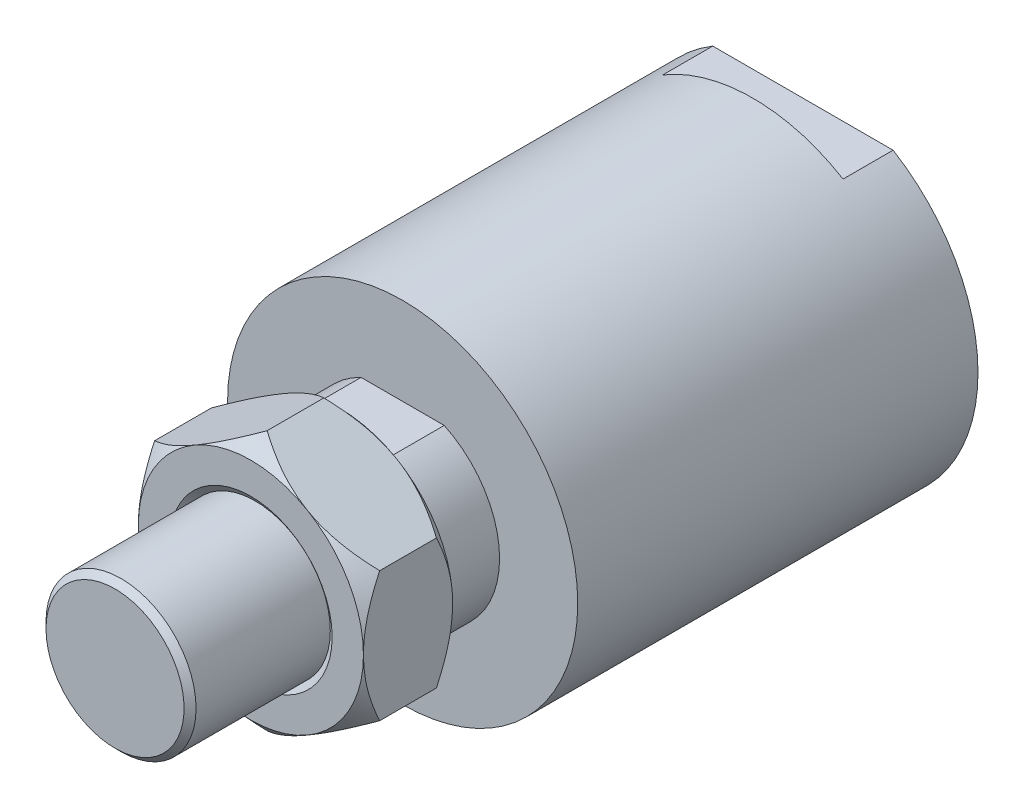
ISO-10303-21;
HEADER;
FILE_DESCRIPTION(('STEP AP214'),'2;1');
FILE_NAME('part.step','',(''),(''),'','','');
FILE_SCHEMA(('AUTOMOTIVE_DESIGN { 1 0 10303 214 1 1 1 1 }'));
ENDSEC;
DATA;
#1=APPLICATION_CONTEXT('core data for automotive mechanical design processes');
#2=APPLICATION_PROTOCOL_DEFINITION('international standard','automotive_design',2000,#1);
#3=PRODUCT_CONTEXT('',#1,'mechanical');
#4=PRODUCT('Part','Part','',(#3));
#5=PRODUCT_RELATED_PRODUCT_CATEGORY('part','',(#4));
#6=PRODUCT_DEFINITION_FORMATION('','',#4);
#7=PRODUCT_DEFINITION_CONTEXT('part definition',#1,'design');
#8=PRODUCT_DEFINITION('design','',#6,#7);
#9=PRODUCT_DEFINITION_SHAPE('','',#8);
#10=(LENGTH_UNIT() NAMED_UNIT(*) SI_UNIT(.MILLI.,.METRE.));
#11=(NAMED_UNIT(*) PLANE_ANGLE_UNIT() SI_UNIT($,.RADIAN.));
#12=(NAMED_UNIT(*) SI_UNIT($,.STERADIAN.) SOLID_ANGLE_UNIT());
#13=UNCERTAINTY_MEASURE_WITH_UNIT(LENGTH_MEASURE(1.E-05),#10,'distance_accuracy_value','');
#14=(GEOMETRIC_REPRESENTATION_CONTEXT(3) GLOBAL_UNCERTAINTY_ASSIGNED_CONTEXT((#13)) GLOBAL_UNIT_ASSIGNED_CONTEXT((#10,
#11,#12)) REPRESENTATION_CONTEXT('',''));
#15=CARTESIAN_POINT('',(0.,0.,0.));
#16=DIRECTION('',(0.,0.,1.));
#17=DIRECTION('',(1.,0.,0.));
#18=AXIS2_PLACEMENT_3D('',#15,#16,#17);
#19=CARTESIAN_POINT('',(-28.575,0.,0.));
#20=DIRECTION('',(0.,0.,1.));
#21=DIRECTION('',(1.,0.,0.));
#22=AXIS2_PLACEMENT_3D('',#19,#20,#21);
#23=PLANE('',#22);
#24=CARTESIAN_POINT('',(0.,0.,0.));
#25=DIRECTION('',(0.,0.,1.));
#26=DIRECTION('',(1.,0.,0.));
#27=AXIS2_PLACEMENT_3D('',#24,#25,#26);
#28=CIRCLE('',#27,14.2875);
#29=CARTESIAN_POINT('',(14.2875,0.,0.));
#30=VERTEX_POINT('',#29);
#31=CARTESIAN_POINT('',(7.14375,12.3733379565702,0.));
#32=VERTEX_POINT('',#31);
#33=EDGE_CURVE('E369',#30,#32,#28,.T.);
#34=ORIENTED_EDGE('',*,*,#33,.F.);
#35=CARTESIAN_POINT('',(0.,0.,0.));
#36=DIRECTION('',(0.,0.,1.));
#37=DIRECTION('',(1.,0.,0.));
#38=AXIS2_PLACEMENT_3D('',#35,#36,#37);
#39=CIRCLE('',#38,14.2875);
#40=CARTESIAN_POINT('',(7.14375,-12.3733379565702,0.));
#41=VERTEX_POINT('',#40);
#42=EDGE_CURVE('E204',#30,#41,#39,.F.);
#43=ORIENTED_EDGE('',*,*,#42,.T.);
#44=CARTESIAN_POINT('',(-7.14375,-12.3733379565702,0.));
#45=VERTEX_POINT('',#44);
#46=EDGE_CURVE('E208',#41,#45,#39,.F.);
#47=ORIENTED_EDGE('',*,*,#46,.T.);
#48=CARTESIAN_POINT('',(-14.2875,0.,0.));
#49=VERTEX_POINT('',#48);
#50=EDGE_CURVE('E609',#45,#49,#39,.F.);
#51=ORIENTED_EDGE('',*,*,#50,.T.);
#52=CARTESIAN_POINT('',(-7.14375,12.3733379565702,0.));
#53=VERTEX_POINT('',#52);
#54=EDGE_CURVE('E611',#49,#53,#39,.F.);
#55=ORIENTED_EDGE('',*,*,#54,.T.);
#56=EDGE_CURVE('E188',#53,#32,#39,.F.);
#57=ORIENTED_EDGE('',*,*,#56,.T.);
#58=EDGE_LOOP('',(#34,#43,#47,#51,#55,#57));
#59=FACE_BOUND('',#58,.T.);
#60=DIRECTION('',(-1.,0.,0.));
#61=VECTOR('',#60,1.);
#62=CARTESIAN_POINT('',(-5.28007845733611,-11.1125,0.));
#63=LINE('',#62,#61);
#64=CARTESIAN_POINT('',(5.28007845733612,-11.1125,0.));
#65=VERTEX_POINT('',#64);
#66=CARTESIAN_POINT('',(-5.28007845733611,-11.1125,0.));
#67=VERTEX_POINT('',#66);
#68=EDGE_CURVE('E38',#65,#67,#63,.T.);
#69=ORIENTED_EDGE('',*,*,#68,.F.);
#70=CARTESIAN_POINT('',(0.,0.,0.));
#71=DIRECTION('',(0.,0.,1.));
#72=DIRECTION('',(1.,0.,0.));
#73=AXIS2_PLACEMENT_3D('',#70,#71,#72);
#74=CIRCLE('',#73,12.303125);
#75=CARTESIAN_POINT('',(5.28007845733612,11.1125,0.));
#76=VERTEX_POINT('',#75);
#77=EDGE_CURVE('E273',#65,#76,#74,.T.);
#78=ORIENTED_EDGE('',*,*,#77,.T.);
#79=DIRECTION('',(1.,0.,0.));
#80=VECTOR('',#79,1.);
#81=CARTESIAN_POINT('',(-5.28007845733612,11.1125,0.));
#82=LINE('',#81,#80);
#83=CARTESIAN_POINT('',(-5.28007845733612,11.1125,0.));
#84=VERTEX_POINT('',#83);
#85=EDGE_CURVE('E224',#84,#76,#82,.T.);
#86=ORIENTED_EDGE('',*,*,#85,.F.);
#87=EDGE_CURVE('E31',#84,#67,#74,.T.);
#88=ORIENTED_EDGE('',*,*,#87,.T.);
#89=EDGE_LOOP('',(#69,#78,#86,#88));
#90=FACE_BOUND('',#89,.T.);
#91=ADVANCED_FACE('F15',(#59,#90),#23,.F.);
#92=CARTESIAN_POINT('',(0.,0.,0.));
#93=DIRECTION('',(0.,0.,1.));
#94=DIRECTION('',(1.,0.,0.));
#95=AXIS2_PLACEMENT_3D('',#92,#93,#94);
#96=CONICAL_SURFACE('',#95,14.2875,0.819669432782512);
#97=CARTESIAN_POINT('',(-0.000200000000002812,16.4978994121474,2.06385781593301));
#98=CARTESIAN_POINT('',(0.260725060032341,16.3472542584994,1.92322125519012));
#99=CARTESIAN_POINT('',(0.523597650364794,16.1954846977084,1.78726644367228));
#100=CARTESIAN_POINT('',(1.05352290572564,15.8895322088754,1.52621851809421));
#101=CARTESIAN_POINT('',(1.32057783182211,15.7353479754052,1.40113153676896));
#102=CARTESIAN_POINT('',(1.86032111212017,15.4237270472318,1.16283383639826));
#103=CARTESIAN_POINT('',(2.13303217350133,15.2662772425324,1.04969125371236));
#104=CARTESIAN_POINT('',(2.68261417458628,14.9489759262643,0.837884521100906));
#105=CARTESIAN_POINT('',(2.95948445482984,14.789124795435,0.739218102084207));
#106=CARTESIAN_POINT('',(3.51232220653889,14.4699437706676,0.55981576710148));
#107=CARTESIAN_POINT('',(3.78821994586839,14.3106541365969,0.478795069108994));
#108=CARTESIAN_POINT('',(4.34347200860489,13.9900792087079,0.334286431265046));
#109=CARTESIAN_POINT('',(4.6228264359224,13.8287938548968,0.270799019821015));
#110=CARTESIAN_POINT('',(5.18368370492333,13.5049827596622,0.163073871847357));
#111=CARTESIAN_POINT('',(5.46518035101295,13.3424605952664,0.118793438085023));
#112=CARTESIAN_POINT('',(6.03001257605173,13.0163545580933,0.0505163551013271));
#113=CARTESIAN_POINT('',(6.3133480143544,12.8527707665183,0.0265181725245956));
#114=CARTESIAN_POINT('',(6.84457480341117,12.5460668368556,0.00123393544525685));
#115=CARTESIAN_POINT('',(7.09237848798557,12.4029973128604,-0.00255816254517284));
#116=CARTESIAN_POINT('',(7.58777426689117,12.1169804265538,0.00591647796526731));
#117=CARTESIAN_POINT('',(7.83536636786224,11.974033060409,0.0181826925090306));
#118=CARTESIAN_POINT('',(8.32974432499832,11.688603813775,0.0585038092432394));
#119=CARTESIAN_POINT('',(8.57652952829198,11.5461223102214,0.086569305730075));
#120=CARTESIAN_POINT('',(9.06844332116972,11.2621157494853,0.157870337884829));
#121=CARTESIAN_POINT('',(9.31357188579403,11.1205907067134,0.201106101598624));
#122=CARTESIAN_POINT('',(9.80175639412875,10.8387372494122,0.301885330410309));
#123=CARTESIAN_POINT('',(10.0448109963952,10.6984096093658,0.35943742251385));
#124=CARTESIAN_POINT('',(10.5283023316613,10.4192657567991,0.487762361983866));
#125=CARTESIAN_POINT('',(10.7687386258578,10.2804497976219,0.55853739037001));
#126=CARTESIAN_POINT('',(11.4854668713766,9.86664655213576,0.788885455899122));
#127=CARTESIAN_POINT('',(11.9574578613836,9.59414242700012,0.966541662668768));
#128=CARTESIAN_POINT('',(12.7401729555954,9.14224165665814,1.29769588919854));
#129=CARTESIAN_POINT('',(13.054297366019,8.96088184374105,1.44081325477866));
#130=CARTESIAN_POINT('',(13.675704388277,8.60211233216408,1.74182453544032));
#131=CARTESIAN_POINT('',(13.9830096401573,8.42468956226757,1.89965594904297));
#132=CARTESIAN_POINT('',(14.2877,8.24877650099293,2.063857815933));
#133=B_SPLINE_CURVE_WITH_KNOTS('',3,(#97,#98,#99,#100,#101,#102,#103,#104,#105,#106,#107,#108,
#109,#110,#111,#112,#113,#114,#115,#116,#117,#118,#119,#120,#121,#122,#123,#124,#125,#126,#127,
#128,#129,#130,#131,#132),.UNSPECIFIED.,.F.,.F.,(4,2,2,2,2,2,2,2,2,2,2,2,2,2,2,2,2,4),(0.,
0.997537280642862,1.99563386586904,2.99914710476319,4.002502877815,4.98821568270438,
5.97395819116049,6.95749801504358,7.94096347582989,8.7990153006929,9.65703912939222,
10.5156389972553,11.374251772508,12.2333832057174,13.0926564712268,14.8102210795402,
15.979716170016,17.1444521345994),.UNSPECIFIED.);
#134=CARTESIAN_POINT('',(14.2875,8.2488919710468,2.06375));
#135=VERTEX_POINT('',#134);
#136=EDGE_CURVE('E352',#32,#135,#133,.T.);
#137=ORIENTED_EDGE('',*,*,#136,.T.);
#138=CARTESIAN_POINT('',(14.2875,-20.0701142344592,9.66261414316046));
#139=CARTESIAN_POINT('',(14.2875,-19.8107251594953,9.46531355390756));
#140=CARTESIAN_POINT('',(14.2875,-19.550720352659,9.26882271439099));
#141=CARTESIAN_POINT('',(14.2875,-19.0293571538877,8.87763711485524));
#142=CARTESIAN_POINT('',(14.2875,-18.7679987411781,8.68294238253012));
#143=CARTESIAN_POINT('',(14.2875,-17.9815926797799,8.10173079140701));
#144=CARTESIAN_POINT('',(14.2875,-17.4543419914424,7.71818400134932));
#145=CARTESIAN_POINT('',(14.2875,-16.3871755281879,6.95681022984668));
#146=CARTESIAN_POINT('',(14.2875,-15.8471846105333,6.57908827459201));
#147=CARTESIAN_POINT('',(14.2875,-14.7586837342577,5.83620546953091));
#148=CARTESIAN_POINT('',(14.2875,-14.210174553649,5.47104348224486));
#149=CARTESIAN_POINT('',(14.2875,-13.0594482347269,4.72862678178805));
#150=CARTESIAN_POINT('',(14.2875,-12.4563892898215,4.35266492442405));
#151=CARTESIAN_POINT('',(14.2875,-11.5407604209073,3.80701439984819));
#152=CARTESIAN_POINT('',(14.2875,-11.2336524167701,3.62814795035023));
#153=CARTESIAN_POINT('',(14.2875,-10.6154129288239,3.27751636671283));
#154=CARTESIAN_POINT('',(14.2875,-10.304281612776,3.10575093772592));
#155=CARTESIAN_POINT('',(14.2875,-9.6789847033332,2.77117204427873));
#156=CARTESIAN_POINT('',(14.2875,-9.3648383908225,2.60832263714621));
#157=CARTESIAN_POINT('',(14.2875,-8.73179023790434,2.29207478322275));
#158=CARTESIAN_POINT('',(14.2875,-8.41288818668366,2.13867675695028));
#159=CARTESIAN_POINT('',(14.2875,-7.77022528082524,1.84297452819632));
#160=CARTESIAN_POINT('',(14.2875,-7.44646787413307,1.70066286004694));
#161=CARTESIAN_POINT('',(14.2875,-6.79364967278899,1.42879336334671));
#162=CARTESIAN_POINT('',(14.2875,-6.46458941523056,1.29923425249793));
#163=CARTESIAN_POINT('',(14.2875,-5.8811851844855,1.08437504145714));
#164=CARTESIAN_POINT('',(14.2875,-5.62799692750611,0.995944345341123));
#165=CARTESIAN_POINT('',(14.2875,-5.11855048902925,0.828498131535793));
#166=CARTESIAN_POINT('',(14.2875,-4.8622923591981,0.749482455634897));
#167=CARTESIAN_POINT('',(14.2875,-4.0888837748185,0.527998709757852));
#168=CARTESIAN_POINT('',(14.2875,-3.56706904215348,0.401082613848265));
#169=CARTESIAN_POINT('',(14.2875,-2.78271854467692,0.248621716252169));
#170=CARTESIAN_POINT('',(14.2875,-2.52370675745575,0.204391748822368));
#171=CARTESIAN_POINT('',(14.2875,-2.00386615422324,0.128438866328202));
#172=CARTESIAN_POINT('',(14.2875,-1.74303762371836,0.0967140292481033));
#173=CARTESIAN_POINT('',(14.2875,-1.22013334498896,0.0463542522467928));
#174=CARTESIAN_POINT('',(14.2875,-0.958057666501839,0.0277185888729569));
#175=CARTESIAN_POINT('',(14.2875,-0.433293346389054,0.00389028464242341));
#176=CARTESIAN_POINT('',(14.2875,-0.170604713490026,-0.00130254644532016));
#177=CARTESIAN_POINT('',(14.2875,0.340322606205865,0.00176979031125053));
#178=CARTESIAN_POINT('',(14.2875,0.588565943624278,0.00931454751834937));
#179=CARTESIAN_POINT('',(14.2875,1.08442358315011,0.0363740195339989));
#180=CARTESIAN_POINT('',(14.2875,1.33203781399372,0.0558900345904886));
#181=CARTESIAN_POINT('',(14.2875,1.82605428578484,0.106560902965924));
#182=CARTESIAN_POINT('',(14.2875,2.07245660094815,0.137715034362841));
#183=CARTESIAN_POINT('',(14.2875,2.56360805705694,0.21115336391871));
#184=CARTESIAN_POINT('',(14.2875,2.80835698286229,0.253438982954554));
#185=CARTESIAN_POINT('',(14.2875,3.54883533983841,0.39788870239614));
#186=CARTESIAN_POINT('',(14.2875,4.04139402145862,0.516647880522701));
#187=CARTESIAN_POINT('',(14.2875,5.01567641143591,0.791479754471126));
#188=CARTESIAN_POINT('',(14.2875,5.49740115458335,0.947548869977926));
#189=CARTESIAN_POINT('',(14.2875,6.55649797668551,1.32898839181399));
#190=CARTESIAN_POINT('',(14.2875,7.13108135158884,1.56205112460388));
#191=CARTESIAN_POINT('',(14.2875,8.26451975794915,2.06400013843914));
#192=CARTESIAN_POINT('',(14.2875,8.8233653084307,2.33290747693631));
#193=CARTESIAN_POINT('',(14.2875,9.92888906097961,2.89920705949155));
#194=CARTESIAN_POINT('',(14.2875,10.4755153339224,3.1966998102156));
#195=CARTESIAN_POINT('',(14.2875,11.5564094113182,3.81294420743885));
#196=CARTESIAN_POINT('',(14.2875,12.0906797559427,4.13169143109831));
#197=CARTESIAN_POINT('',(14.2875,13.1168584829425,4.76600110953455));
#198=CARTESIAN_POINT('',(14.2875,13.6093732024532,5.08058796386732));
#199=CARTESIAN_POINT('',(14.2875,14.5867110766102,5.72153393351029));
#200=CARTESIAN_POINT('',(14.2875,15.0715336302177,6.04789396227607));
#201=CARTESIAN_POINT('',(14.2875,16.0303250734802,6.70717108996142));
#202=CARTESIAN_POINT('',(14.2875,16.5043522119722,7.04000367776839));
#203=CARTESIAN_POINT('',(14.2875,17.2112134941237,7.54496173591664));
#204=CARTESIAN_POINT('',(14.2875,17.446109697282,7.7142121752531));
#205=CARTESIAN_POINT('',(14.2875,17.914627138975,8.05446083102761));
#206=CARTESIAN_POINT('',(14.2875,18.1482483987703,8.2254590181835));
#207=CARTESIAN_POINT('',(14.2875,18.3812855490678,8.39725006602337));
#208=B_SPLINE_CURVE_WITH_KNOTS('',3,(#138,#139,#140,#141,#142,#143,#144,#145,#146,#147,#148,
#149,#150,#151,#152,#153,#154,#155,#156,#157,#158,#159,#160,#161,#162,#163,#164,#165,#166,#167,
#168,#169,#170,#171,#172,#173,#174,#175,#176,#177,#178,#179,#180,#181,#182,#183,#184,#185,#186,
#187,#188,#189,#190,#191,#192,#193,#194,#195,#196,#197,#198,#199,#200,#201,#202,#203,#204,#205,
#206,#207),.UNSPECIFIED.,.F.,.F.,(4,2,2,2,2,2,2,2,2,2,2,2,2,2,2,2,2,2,2,2,2,2,2,2,2,2,2,2,2,2,2,
2,2,2,4),(0.,0.977694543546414,1.95540413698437,3.911305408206,5.88812245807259,
7.86476000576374,9.99620983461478,11.0623324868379,12.1284108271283,13.1898156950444,
14.2512677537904,15.3119987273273,16.37262293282,17.1770036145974,17.9813707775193,
19.5900089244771,20.3780516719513,21.1659732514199,21.9538512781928,22.7417181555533,
23.4865012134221,24.2313651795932,24.9761829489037,25.721095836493,27.239185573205,
28.7571296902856,30.615631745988,32.4752304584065,34.3416250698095,36.2076325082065,
37.9606629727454,39.7138297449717,41.4513505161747,42.3199045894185,43.1884441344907),.UNSPECIFIED.);
#209=EDGE_CURVE('E184',#30,#135,#208,.T.);
#210=ORIENTED_EDGE('',*,*,#209,.F.);
#211=ORIENTED_EDGE('',*,*,#33,.T.);
#212=EDGE_LOOP('',(#137,#210,#211));
#213=FACE_BOUND('',#212,.T.);
#214=ADVANCED_FACE('F342',(#213),#96,.T.);
#215=CARTESIAN_POINT('',(14.2877,-8.24877650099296,2.06385781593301));
#216=CARTESIAN_POINT('',(14.0267749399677,-8.39942165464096,1.92322125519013));
#217=CARTESIAN_POINT('',(13.7639023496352,-8.55119121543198,1.7872664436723));
#218=CARTESIAN_POINT('',(13.2339770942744,-8.85714370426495,1.52621851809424));
#219=CARTESIAN_POINT('',(12.9669221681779,-9.01132793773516,1.40113153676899));
#220=CARTESIAN_POINT('',(12.4271788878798,-9.32294886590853,1.16283383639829));
#221=CARTESIAN_POINT('',(12.1544678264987,-9.48039867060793,1.04969125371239));
#222=CARTESIAN_POINT('',(11.6048858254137,-9.7976999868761,0.83788452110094));
#223=CARTESIAN_POINT('',(11.3280155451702,-9.95755111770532,0.73921810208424));
#224=CARTESIAN_POINT('',(10.7751777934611,-10.2767321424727,0.559815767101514));
#225=CARTESIAN_POINT('',(10.4992800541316,-10.4360217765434,0.478795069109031));
#226=CARTESIAN_POINT('',(9.94402799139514,-10.7565967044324,0.334286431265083));
#227=CARTESIAN_POINT('',(9.66467356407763,-10.9178820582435,0.270799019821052));
#228=CARTESIAN_POINT('',(9.10381629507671,-11.2416931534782,0.163073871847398));
#229=CARTESIAN_POINT('',(8.8223196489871,-11.404215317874,0.118793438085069));
#230=CARTESIAN_POINT('',(8.25748742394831,-11.7303213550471,0.0505163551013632));
#231=CARTESIAN_POINT('',(7.97415198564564,-11.8939051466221,0.0265181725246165));
#232=CARTESIAN_POINT('',(7.44292519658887,-12.2006090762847,0.00123393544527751));
#233=CARTESIAN_POINT('',(7.19512151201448,-12.34367860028,-0.0025581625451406));
#234=CARTESIAN_POINT('',(6.69972573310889,-12.6296954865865,0.00591647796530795));
#235=CARTESIAN_POINT('',(6.45213363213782,-12.7726428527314,0.018182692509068));
#236=CARTESIAN_POINT('',(5.95775567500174,-13.0580720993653,0.058503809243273));
#237=CARTESIAN_POINT('',(5.71097047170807,-13.2005536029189,0.0865693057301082));
#238=CARTESIAN_POINT('',(5.21905667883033,-13.484560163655,0.157870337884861));
#239=CARTESIAN_POINT('',(4.97392811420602,-13.6260852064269,0.201106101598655));
#240=CARTESIAN_POINT('',(4.4857436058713,-13.9079386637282,0.301885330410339));
#241=CARTESIAN_POINT('',(4.2426890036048,-14.0482663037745,0.35943742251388));
#242=CARTESIAN_POINT('',(3.75919766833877,-14.3274101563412,0.487762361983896));
#243=CARTESIAN_POINT('',(3.5187613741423,-14.4662261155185,0.558537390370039));
#244=CARTESIAN_POINT('',(2.80203312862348,-14.8800293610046,0.788885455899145));
#245=CARTESIAN_POINT('',(2.33004213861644,-15.1525334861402,0.96654166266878));
#246=CARTESIAN_POINT('',(1.54732704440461,-15.6044342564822,1.29769588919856));
#247=CARTESIAN_POINT('',(1.23320263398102,-15.7857940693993,1.44081325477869));
#248=CARTESIAN_POINT('',(0.611795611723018,-16.1445635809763,1.74182453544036));
#249=CARTESIAN_POINT('',(0.304490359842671,-16.3219863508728,1.89965594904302));
#250=CARTESIAN_POINT('',(-0.000199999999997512,-16.4978994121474,2.06385781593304));
#251=B_SPLINE_CURVE_WITH_KNOTS('',3,(#215,#216,#217,#218,#219,#220,#221,#222,#223,#224,#225,
#226,#227,#228,#229,#230,#231,#232,#233,#234,#235,#236,#237,#238,#239,#240,#241,#242,#243,#244,
#245,#246,#247,#248,#249,#250),.UNSPECIFIED.,.F.,.F.,(4,2,2,2,2,2,2,2,2,2,2,2,2,2,2,2,2,4),(0.,
0.997537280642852,1.99563386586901,2.99914710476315,4.00250287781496,4.98821568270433,
5.97395819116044,6.95749801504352,7.94096347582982,8.79901530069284,9.65703912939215,
10.5156389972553,11.3742517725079,12.2333832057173,13.0926564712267,14.8102210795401,
15.979716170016,17.1444521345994),.UNSPECIFIED.);
#252=CARTESIAN_POINT('',(14.2875,-8.24889197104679,2.06375));
#253=VERTEX_POINT('',#252);
#254=EDGE_CURVE('E568',#253,#41,#251,.T.);
#255=ORIENTED_EDGE('',*,*,#254,.T.);
#256=ORIENTED_EDGE('',*,*,#42,.F.);
#257=EDGE_CURVE('E570',#253,#30,#208,.T.);
#258=ORIENTED_EDGE('',*,*,#257,.F.);
#259=EDGE_LOOP('',(#255,#256,#258));
#260=FACE_BOUND('',#259,.T.);
#261=ADVANCED_FACE('F602',(#260),#96,.T.);
#262=CARTESIAN_POINT('',(0.,-16.4977839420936,2.06375));
#263=VERTEX_POINT('',#262);
#264=EDGE_CURVE('E562',#41,#263,#251,.T.);
#265=ORIENTED_EDGE('',*,*,#264,.T.);
#266=CARTESIAN_POINT('',(0.000200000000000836,-16.4978994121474,2.06385781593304));
#267=CARTESIAN_POINT('',(-0.260725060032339,-16.3472542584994,1.92322125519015));
#268=CARTESIAN_POINT('',(-0.523597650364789,-16.1954846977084,1.78726644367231));
#269=CARTESIAN_POINT('',(-1.05352290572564,-15.8895322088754,1.52621851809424));
#270=CARTESIAN_POINT('',(-1.3205778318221,-15.7353479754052,1.40113153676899));
#271=CARTESIAN_POINT('',(-1.86032111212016,-15.4237270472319,1.16283383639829));
#272=CARTESIAN_POINT('',(-2.13303217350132,-15.2662772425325,1.04969125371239));
#273=CARTESIAN_POINT('',(-2.68261417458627,-14.9489759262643,0.837884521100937));
#274=CARTESIAN_POINT('',(-2.95948445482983,-14.7891247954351,0.739218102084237));
#275=CARTESIAN_POINT('',(-3.51232220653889,-14.4699437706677,0.559815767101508));
#276=CARTESIAN_POINT('',(-3.78821994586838,-14.310654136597,0.478795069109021));
#277=CARTESIAN_POINT('',(-4.34347200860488,-13.9900792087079,0.334286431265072));
#278=CARTESIAN_POINT('',(-4.6228264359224,-13.8287938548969,0.270799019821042));
#279=CARTESIAN_POINT('',(-5.18368370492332,-13.5049827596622,0.163073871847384));
#280=CARTESIAN_POINT('',(-5.46518035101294,-13.3424605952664,0.118793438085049));
#281=CARTESIAN_POINT('',(-6.03001257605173,-13.0163545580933,0.0505163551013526));
#282=CARTESIAN_POINT('',(-6.3133480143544,-12.8527707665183,0.0265181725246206));
#283=CARTESIAN_POINT('',(-6.84457480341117,-12.5460668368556,0.00123393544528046));
#284=CARTESIAN_POINT('',(-7.09237848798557,-12.4029973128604,-0.00255816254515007));
#285=CARTESIAN_POINT('',(-7.58777426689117,-12.1169804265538,0.00591647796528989));
#286=CARTESIAN_POINT('',(-7.83536636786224,-11.974033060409,0.0181826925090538));
#287=CARTESIAN_POINT('',(-8.32974432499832,-11.688603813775,0.0585038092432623));
#288=CARTESIAN_POINT('',(-8.57652952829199,-11.5461223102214,0.086569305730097));
#289=CARTESIAN_POINT('',(-9.06844332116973,-11.2621157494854,0.157870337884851));
#290=CARTESIAN_POINT('',(-9.31357188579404,-11.1205907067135,0.201106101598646));
#291=CARTESIAN_POINT('',(-9.80175639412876,-10.8387372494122,0.301885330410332));
#292=CARTESIAN_POINT('',(-10.0448109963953,-10.6984096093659,0.359437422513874));
#293=CARTESIAN_POINT('',(-10.5283023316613,-10.4192657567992,0.48776236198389));
#294=CARTESIAN_POINT('',(-10.7687386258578,-10.2804497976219,0.558537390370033));
#295=CARTESIAN_POINT('',(-11.4854668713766,-9.86664655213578,0.788885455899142));
#296=CARTESIAN_POINT('',(-11.9574578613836,-9.59414242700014,0.966541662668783));
#297=CARTESIAN_POINT('',(-12.7401729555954,-9.14224165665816,1.29769588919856));
#298=CARTESIAN_POINT('',(-13.054297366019,-8.96088184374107,1.44081325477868));
#299=CARTESIAN_POINT('',(-13.675704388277,-8.6021123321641,1.74182453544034));
#300=CARTESIAN_POINT('',(-13.9830096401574,-8.4246895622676,1.89965594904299));
#301=CARTESIAN_POINT('',(-14.2877,-8.24877650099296,2.06385781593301));
#302=B_SPLINE_CURVE_WITH_KNOTS('',3,(#266,#267,#268,#269,#270,#271,#272,#273,#274,#275,#276,
#277,#278,#279,#280,#281,#282,#283,#284,#285,#286,#287,#288,#289,#290,#291,#292,#293,#294,#295,
#296,#297,#298,#299,#300,#301),.UNSPECIFIED.,.F.,.F.,(4,2,2,2,2,2,2,2,2,2,2,2,2,2,2,2,2,4),(0.,
0.997537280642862,1.99563386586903,2.99914710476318,4.002502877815,4.98821568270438,
5.97395819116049,6.95749801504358,7.94096347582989,8.79901530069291,9.65703912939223,
10.5156389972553,11.374251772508,12.2333832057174,13.0926564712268,14.8102210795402,
15.979716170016,17.1444521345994),.UNSPECIFIED.);
#303=EDGE_CURVE('E569',#263,#45,#302,.T.);
#304=ORIENTED_EDGE('',*,*,#303,.T.);
#305=ORIENTED_EDGE('',*,*,#46,.F.);
#306=EDGE_LOOP('',(#265,#304,#305));
#307=FACE_BOUND('',#306,.T.);
#308=ADVANCED_FACE('F605',(#307),#96,.T.);
#309=CARTESIAN_POINT('',(-14.2875,-8.2488919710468,2.06375));
#310=VERTEX_POINT('',#309);
#311=EDGE_CURVE('E541',#45,#310,#302,.T.);
#312=ORIENTED_EDGE('',*,*,#311,.T.);
#313=CARTESIAN_POINT('',(-14.2875,-20.0701142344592,9.66261414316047));
#314=CARTESIAN_POINT('',(-14.2875,-19.8107251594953,9.46531355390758));
#315=CARTESIAN_POINT('',(-14.2875,-19.5507203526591,9.26882271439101));
#316=CARTESIAN_POINT('',(-14.2875,-19.0293571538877,8.87763711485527));
#317=CARTESIAN_POINT('',(-14.2875,-18.7679987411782,8.68294238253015));
#318=CARTESIAN_POINT('',(-14.2875,-17.9815926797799,8.10173079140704));
#319=CARTESIAN_POINT('',(-14.2875,-17.4543419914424,7.71818400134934));
#320=CARTESIAN_POINT('',(-14.2875,-16.3871755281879,6.9568102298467));
#321=CARTESIAN_POINT('',(-14.2875,-15.8471846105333,6.57908827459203));
#322=CARTESIAN_POINT('',(-14.2875,-14.7586837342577,5.83620546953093));
#323=CARTESIAN_POINT('',(-14.2875,-14.210174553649,5.47104348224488));
#324=CARTESIAN_POINT('',(-14.2875,-13.0594482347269,4.72862678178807));
#325=CARTESIAN_POINT('',(-14.2875,-12.4563892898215,4.35266492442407));
#326=CARTESIAN_POINT('',(-14.2875,-11.5407604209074,3.8070143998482));
#327=CARTESIAN_POINT('',(-14.2875,-11.2336524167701,3.62814795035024));
#328=CARTESIAN_POINT('',(-14.2875,-10.615412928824,3.27751636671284));
#329=CARTESIAN_POINT('',(-14.2875,-10.304281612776,3.10575093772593));
#330=CARTESIAN_POINT('',(-14.2875,-9.67898470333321,2.77117204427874));
#331=CARTESIAN_POINT('',(-14.2875,-9.36483839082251,2.60832263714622));
#332=CARTESIAN_POINT('',(-14.2875,-8.73179023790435,2.29207478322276));
#333=CARTESIAN_POINT('',(-14.2875,-8.41288818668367,2.13867675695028));
#334=CARTESIAN_POINT('',(-14.2875,-7.77022528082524,1.84297452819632));
#335=CARTESIAN_POINT('',(-14.2875,-7.44646787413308,1.70066286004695));
#336=CARTESIAN_POINT('',(-14.2875,-6.79364967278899,1.42879336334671));
#337=CARTESIAN_POINT('',(-14.2875,-6.46458941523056,1.29923425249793));
#338=CARTESIAN_POINT('',(-14.2875,-5.8811851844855,1.08437504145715));
#339=CARTESIAN_POINT('',(-14.2875,-5.62799692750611,0.995944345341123));
#340=CARTESIAN_POINT('',(-14.2875,-5.11855048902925,0.828498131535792));
#341=CARTESIAN_POINT('',(-14.2875,-4.8622923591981,0.749482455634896));
#342=CARTESIAN_POINT('',(-14.2875,-4.0888837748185,0.527998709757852));
#343=CARTESIAN_POINT('',(-14.2875,-3.56706904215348,0.401082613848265));
#344=CARTESIAN_POINT('',(-14.2875,-2.78271854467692,0.248621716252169));
#345=CARTESIAN_POINT('',(-14.2875,-2.52370675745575,0.204391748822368));
#346=CARTESIAN_POINT('',(-14.2875,-2.00386615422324,0.128438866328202));
#347=CARTESIAN_POINT('',(-14.2875,-1.74303762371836,0.0967140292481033));
#348=CARTESIAN_POINT('',(-14.2875,-1.22013334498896,0.0463542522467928));
#349=CARTESIAN_POINT('',(-14.2875,-0.958057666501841,0.0277185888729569));
#350=CARTESIAN_POINT('',(-14.2875,-0.433293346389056,0.0038902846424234));
#351=CARTESIAN_POINT('',(-14.2875,-0.170604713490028,-0.00130254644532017));
#352=CARTESIAN_POINT('',(-14.2875,0.340322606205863,0.00176979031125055));
#353=CARTESIAN_POINT('',(-14.2875,0.588565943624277,0.00931454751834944));
#354=CARTESIAN_POINT('',(-14.2875,1.08442358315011,0.0363740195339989));
#355=CARTESIAN_POINT('',(-14.2875,1.33203781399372,0.0558900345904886));
#356=CARTESIAN_POINT('',(-14.2875,1.82605428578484,0.106560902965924));
#357=CARTESIAN_POINT('',(-14.2875,2.07245660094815,0.137715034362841));
#358=CARTESIAN_POINT('',(-14.2875,2.56360805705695,0.21115336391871));
#359=CARTESIAN_POINT('',(-14.2875,2.80835698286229,0.253438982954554));
#360=CARTESIAN_POINT('',(-14.2875,3.54883533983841,0.397888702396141));
#361=CARTESIAN_POINT('',(-14.2875,4.04139402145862,0.516647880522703));
#362=CARTESIAN_POINT('',(-14.2875,5.01567641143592,0.791479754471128));
#363=CARTESIAN_POINT('',(-14.2875,5.49740115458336,0.947548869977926));
#364=CARTESIAN_POINT('',(-14.2875,6.55649797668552,1.32898839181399));
#365=CARTESIAN_POINT('',(-14.2875,7.13108135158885,1.56205112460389));
#366=CARTESIAN_POINT('',(-14.2875,8.26451975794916,2.06400013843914));
#367=CARTESIAN_POINT('',(-14.2875,8.82336530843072,2.33290747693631));
#368=CARTESIAN_POINT('',(-14.2875,9.92888906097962,2.89920705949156));
#369=CARTESIAN_POINT('',(-14.2875,10.4755153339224,3.19669981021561));
#370=CARTESIAN_POINT('',(-14.2875,11.5564094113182,3.81294420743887));
#371=CARTESIAN_POINT('',(-14.2875,12.0906797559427,4.13169143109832));
#372=CARTESIAN_POINT('',(-14.2875,13.1168584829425,4.76600110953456));
#373=CARTESIAN_POINT('',(-14.2875,13.6093732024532,5.08058796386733));
#374=CARTESIAN_POINT('',(-14.2875,14.5867110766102,5.72153393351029));
#375=CARTESIAN_POINT('',(-14.2875,15.0715336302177,6.04789396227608));
#376=CARTESIAN_POINT('',(-14.2875,16.0303250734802,6.70717108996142));
#377=CARTESIAN_POINT('',(-14.2875,16.5043522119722,7.0400036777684));
#378=CARTESIAN_POINT('',(-14.2875,17.2112134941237,7.54496173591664));
#379=CARTESIAN_POINT('',(-14.2875,17.446109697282,7.71421217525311));
#380=CARTESIAN_POINT('',(-14.2875,17.914627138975,8.05446083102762));
#381=CARTESIAN_POINT('',(-14.2875,18.1482483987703,8.22545901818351));
#382=CARTESIAN_POINT('',(-14.2875,18.3812855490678,8.39725006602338));
#383=B_SPLINE_CURVE_WITH_KNOTS('',3,(#313,#314,#315,#316,#317,#318,#319,#320,#321,#322,#323,
#324,#325,#326,#327,#328,#329,#330,#331,#332,#333,#334,#335,#336,#337,#338,#339,#340,#341,#342,
#343,#344,#345,#346,#347,#348,#349,#350,#351,#352,#353,#354,#355,#356,#357,#358,#359,#360,#361,
#362,#363,#364,#365,#366,#367,#368,#369,#370,#371,#372,#373,#374,#375,#376,#377,#378,#379,#380,
#381,#382),.UNSPECIFIED.,.F.,.F.,(4,2,2,2,2,2,2,2,2,2,2,2,2,2,2,2,2,2,2,2,2,2,2,2,2,2,2,2,2,2,2,
2,2,2,4),(0.,0.977694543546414,1.95540413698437,3.911305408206,5.8881224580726,7.86476000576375,
9.9962098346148,11.0623324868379,12.1284108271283,13.1898156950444,14.2512677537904,
15.3119987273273,16.3726229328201,17.1770036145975,17.9813707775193,19.5900089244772,
20.3780516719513,21.1659732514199,21.9538512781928,22.7417181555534,23.4865012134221,
24.2313651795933,24.9761829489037,25.721095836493,27.239185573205,28.7571296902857,
30.615631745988,32.4752304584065,34.3416250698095,36.2076325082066,37.9606629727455,
39.7138297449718,41.4513505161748,42.3199045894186,43.1884441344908),.UNSPECIFIED.);
#384=EDGE_CURVE('E538',#310,#49,#383,.T.);
#385=ORIENTED_EDGE('',*,*,#384,.T.);
#386=ORIENTED_EDGE('',*,*,#50,.F.);
#387=EDGE_LOOP('',(#312,#385,#386));
#388=FACE_BOUND('',#387,.T.);
#389=ADVANCED_FACE('F331',(#388),#96,.T.);
#390=CARTESIAN_POINT('',(-14.2877,8.24877650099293,2.063857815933));
#391=CARTESIAN_POINT('',(-14.0267749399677,8.39942165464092,1.92322125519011));
#392=CARTESIAN_POINT('',(-13.7639023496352,8.55119121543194,1.78726644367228));
#393=CARTESIAN_POINT('',(-13.2339770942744,8.85714370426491,1.52621851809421));
#394=CARTESIAN_POINT('',(-12.9669221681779,9.01132793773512,1.40113153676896));
#395=CARTESIAN_POINT('',(-12.4271788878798,9.32294886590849,1.16283383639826));
#396=CARTESIAN_POINT('',(-12.1544678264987,9.48039867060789,1.04969125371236));
#397=CARTESIAN_POINT('',(-11.6048858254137,9.79769998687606,0.837884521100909));
#398=CARTESIAN_POINT('',(-11.3280155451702,9.95755111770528,0.739218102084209));
#399=CARTESIAN_POINT('',(-10.7751777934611,10.2767321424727,0.559815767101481));
#400=CARTESIAN_POINT('',(-10.4992800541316,10.4360217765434,0.478795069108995));
#401=CARTESIAN_POINT('',(-9.94402799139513,10.7565967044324,0.334286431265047));
#402=CARTESIAN_POINT('',(-9.66467356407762,10.9178820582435,0.270799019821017));
#403=CARTESIAN_POINT('',(-9.10381629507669,11.2416931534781,0.163073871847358));
#404=CARTESIAN_POINT('',(-8.82231964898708,11.4042153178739,0.118793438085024));
#405=CARTESIAN_POINT('',(-8.25748742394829,11.730321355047,0.0505163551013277));
#406=CARTESIAN_POINT('',(-7.97415198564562,11.893905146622,0.0265181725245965));
#407=CARTESIAN_POINT('',(-7.44292519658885,12.2006090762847,0.00123393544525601));
#408=CARTESIAN_POINT('',(-7.19512151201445,12.3436786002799,-0.00255816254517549));
#409=CARTESIAN_POINT('',(-6.69972573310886,12.6296954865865,0.00591647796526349));
#410=CARTESIAN_POINT('',(-6.45213363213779,12.7726428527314,0.0181826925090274));
#411=CARTESIAN_POINT('',(-5.95775567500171,13.0580720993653,0.0585038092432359));
#412=CARTESIAN_POINT('',(-5.71097047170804,13.2005536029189,0.0865693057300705));
#413=CARTESIAN_POINT('',(-5.21905667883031,13.484560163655,0.157870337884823));
#414=CARTESIAN_POINT('',(-4.97392811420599,13.6260852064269,0.201106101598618));
#415=CARTESIAN_POINT('',(-4.48574360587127,13.9079386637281,0.301885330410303));
#416=CARTESIAN_POINT('',(-4.24268900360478,14.0482663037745,0.359437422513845));
#417=CARTESIAN_POINT('',(-3.75919766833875,14.3274101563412,0.48776236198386));
#418=CARTESIAN_POINT('',(-3.51876137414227,14.4662261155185,0.558537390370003));
#419=CARTESIAN_POINT('',(-2.80203312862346,14.8800293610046,0.788885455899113));
#420=CARTESIAN_POINT('',(-2.33004213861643,15.1525334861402,0.966541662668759));
#421=CARTESIAN_POINT('',(-1.54732704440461,15.6044342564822,1.29769588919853));
#422=CARTESIAN_POINT('',(-1.23320263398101,15.7857940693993,1.44081325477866));
#423=CARTESIAN_POINT('',(-0.611795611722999,16.1445635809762,1.74182453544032));
#424=CARTESIAN_POINT('',(-0.304490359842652,16.3219863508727,1.89965594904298));
#425=CARTESIAN_POINT('',(0.000199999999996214,16.4978994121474,2.06385781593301));
#426=B_SPLINE_CURVE_WITH_KNOTS('',3,(#390,#391,#392,#393,#394,#395,#396,#397,#398,#399,#400,
#401,#402,#403,#404,#405,#406,#407,#408,#409,#410,#411,#412,#413,#414,#415,#416,#417,#418,#419,
#420,#421,#422,#423,#424,#425),.UNSPECIFIED.,.F.,.F.,(4,2,2,2,2,2,2,2,2,2,2,2,2,2,2,2,2,4),(0.,
0.997537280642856,1.99563386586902,2.99914710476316,4.00250287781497,4.98821568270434,
5.97395819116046,6.95749801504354,7.94096347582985,8.79901530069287,9.65703912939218,
10.5156389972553,11.374251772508,12.2333832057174,13.0926564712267,14.8102210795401,
15.979716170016,17.1444521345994),.UNSPECIFIED.);
#427=CARTESIAN_POINT('',(-14.2875,8.2488919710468,2.06375));
#428=VERTEX_POINT('',#427);
#429=EDGE_CURVE('E533',#428,#53,#426,.T.);
#430=ORIENTED_EDGE('',*,*,#429,.T.);
#431=ORIENTED_EDGE('',*,*,#54,.F.);
#432=EDGE_CURVE('E536',#49,#428,#383,.T.);
#433=ORIENTED_EDGE('',*,*,#432,.T.);
#434=EDGE_LOOP('',(#430,#431,#433));
#435=FACE_BOUND('',#434,.T.);
#436=ADVANCED_FACE('F613',(#435),#96,.T.);
#437=CARTESIAN_POINT('',(0.,16.4977839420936,2.06375));
#438=VERTEX_POINT('',#437);
#439=EDGE_CURVE('E203',#53,#438,#426,.T.);
#440=ORIENTED_EDGE('',*,*,#439,.T.);
#441=EDGE_CURVE('E580',#438,#32,#133,.T.);
#442=ORIENTED_EDGE('',*,*,#441,.T.);
#443=ORIENTED_EDGE('',*,*,#56,.F.);
#444=EDGE_LOOP('',(#440,#442,#443));
#445=FACE_BOUND('',#444,.T.);
#446=ADVANCED_FACE('F348',(#445),#96,.T.);
#447=CARTESIAN_POINT('',(14.2875,8.24889197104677,0.));
#448=DIRECTION('',(0.5,0.866025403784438,0.));
#449=DIRECTION('',(-0.866025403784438,0.5,0.));
#450=AXIS2_PLACEMENT_3D('',#447,#448,#449);
#451=PLANE('',#450);
#452=DIRECTION('',(0.,0.,1.));
#453=VECTOR('',#452,1.);
#454=CARTESIAN_POINT('',(0.,16.4977839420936,0.));
#455=LINE('',#454,#453);
#456=CARTESIAN_POINT('',(0.,16.4977839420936,9.26465));
#457=VERTEX_POINT('',#456);
#458=EDGE_CURVE('E185',#438,#457,#455,.T.);
#459=ORIENTED_EDGE('',*,*,#458,.T.);
#460=CARTESIAN_POINT('',(-0.000200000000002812,16.4978994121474,9.26454218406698));
#461=CARTESIAN_POINT('',(0.26072506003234,16.3472542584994,9.40517874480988));
#462=CARTESIAN_POINT('',(0.523597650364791,16.1954846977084,9.54113355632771));
#463=CARTESIAN_POINT('',(1.05352290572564,15.8895322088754,9.80218148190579));
#464=CARTESIAN_POINT('',(1.32057783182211,15.7353479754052,9.92726846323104));
#465=CARTESIAN_POINT('',(1.86032111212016,15.4237270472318,10.1655661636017));
#466=CARTESIAN_POINT('',(2.13303217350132,15.2662772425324,10.2787087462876));
#467=CARTESIAN_POINT('',(2.68261417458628,14.9489759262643,10.4905154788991));
#468=CARTESIAN_POINT('',(2.95948445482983,14.789124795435,10.5891818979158));
#469=CARTESIAN_POINT('',(3.51232220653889,14.4699437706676,10.7685842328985));
#470=CARTESIAN_POINT('',(3.78821994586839,14.3106541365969,10.849604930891));
#471=CARTESIAN_POINT('',(4.34347200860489,13.9900792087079,10.994113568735));
#472=CARTESIAN_POINT('',(4.6228264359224,13.8287938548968,11.057600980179));
#473=CARTESIAN_POINT('',(5.18368370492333,13.5049827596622,11.1653261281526));
#474=CARTESIAN_POINT('',(5.46518035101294,13.3424605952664,11.209606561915));
#475=CARTESIAN_POINT('',(6.03001257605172,13.0163545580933,11.2778836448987));
#476=CARTESIAN_POINT('',(6.31334801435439,12.8527707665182,11.3018818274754));
#477=CARTESIAN_POINT('',(6.84457480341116,12.5460668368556,11.3271660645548));
#478=CARTESIAN_POINT('',(7.09237848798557,12.4029973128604,11.3309581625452));
#479=CARTESIAN_POINT('',(7.58777426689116,12.1169804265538,11.3224835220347));
#480=CARTESIAN_POINT('',(7.83536636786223,11.974033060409,11.310217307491));
#481=CARTESIAN_POINT('',(8.32974432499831,11.688603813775,11.2698961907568));
#482=CARTESIAN_POINT('',(8.57652952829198,11.5461223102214,11.2418306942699));
#483=CARTESIAN_POINT('',(9.06844332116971,11.2621157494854,11.1705296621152));
#484=CARTESIAN_POINT('',(9.31357188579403,11.1205907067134,11.1272938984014));
#485=CARTESIAN_POINT('',(9.80175639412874,10.8387372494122,11.0265146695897));
#486=CARTESIAN_POINT('',(10.0448109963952,10.6984096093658,10.9689625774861));
#487=CARTESIAN_POINT('',(10.5283023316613,10.4192657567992,10.8406376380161));
#488=CARTESIAN_POINT('',(10.7687386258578,10.2804497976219,10.76986260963));
#489=CARTESIAN_POINT('',(11.4854668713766,9.86664655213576,10.5395145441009));
#490=CARTESIAN_POINT('',(11.9574578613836,9.59414242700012,10.3618583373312));
#491=CARTESIAN_POINT('',(12.7401729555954,9.14224165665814,10.0307041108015));
#492=CARTESIAN_POINT('',(13.054297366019,8.96088184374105,9.88758674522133));
#493=CARTESIAN_POINT('',(13.675704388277,8.60211233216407,9.58657546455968));
#494=CARTESIAN_POINT('',(13.9830096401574,8.42468956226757,9.42874405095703));
#495=CARTESIAN_POINT('',(14.2877,8.24877650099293,9.264542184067));
#496=B_SPLINE_CURVE_WITH_KNOTS('',3,(#460,#461,#462,#463,#464,#465,#466,#467,#468,#469,#470,
#471,#472,#473,#474,#475,#476,#477,#478,#479,#480,#481,#482,#483,#484,#485,#486,#487,#488,#489,
#490,#491,#492,#493,#494,#495),.UNSPECIFIED.,.F.,.F.,(4,2,2,2,2,2,2,2,2,2,2,2,2,2,2,2,2,4),(0.,
0.997537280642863,1.99563386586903,2.99914710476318,4.002502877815,4.98821568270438,
5.97395819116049,6.95749801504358,7.94096347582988,8.7990153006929,9.65703912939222,
10.5156389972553,11.374251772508,12.2333832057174,13.0926564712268,14.8102210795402,
15.979716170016,17.1444521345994),.UNSPECIFIED.);
#497=CARTESIAN_POINT('',(7.14375,12.3733379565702,11.3284));
#498=VERTEX_POINT('',#497);
#499=EDGE_CURVE('E178',#457,#498,#496,.T.);
#500=ORIENTED_EDGE('',*,*,#499,.T.);
#501=CARTESIAN_POINT('',(14.2875,8.2488919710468,9.26465));
#502=VERTEX_POINT('',#501);
#503=EDGE_CURVE('E160',#498,#502,#496,.T.);
#504=ORIENTED_EDGE('',*,*,#503,.T.);
#505=DIRECTION('',(0.,0.,1.));
#506=VECTOR('',#505,1.);
#507=CARTESIAN_POINT('',(14.2875,8.24889197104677,0.));
#508=LINE('',#507,#506);
#509=EDGE_CURVE('E177',#135,#502,#508,.T.);
#510=ORIENTED_EDGE('',*,*,#509,.F.);
#511=ORIENTED_EDGE('',*,*,#136,.F.);
#512=ORIENTED_EDGE('',*,*,#441,.F.);
#513=EDGE_LOOP('',(#459,#500,#504,#510,#511,#512));
#514=FACE_BOUND('',#513,.T.);
#515=ADVANCED_FACE('F175',(#514),#451,.T.);
#516=CARTESIAN_POINT('',(14.2875,8.24889197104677,0.));
#517=DIRECTION('',(-1.,0.,0.));
#518=DIRECTION('',(0.,0.,1.));
#519=AXIS2_PLACEMENT_3D('',#516,#517,#518);
#520=PLANE('',#519);
#521=CARTESIAN_POINT('',(14.2875,-20.0701142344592,1.66578585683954));
#522=CARTESIAN_POINT('',(14.2875,-19.8107251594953,1.86308644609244));
#523=CARTESIAN_POINT('',(14.2875,-19.550720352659,2.05957728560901));
#524=CARTESIAN_POINT('',(14.2875,-19.0293571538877,2.45076288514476));
#525=CARTESIAN_POINT('',(14.2875,-18.7679987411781,2.64545761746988));
#526=CARTESIAN_POINT('',(14.2875,-17.9815926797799,3.22666920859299));
#527=CARTESIAN_POINT('',(14.2875,-17.4543419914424,3.61021599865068));
#528=CARTESIAN_POINT('',(14.2875,-16.3871755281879,4.37158977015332));
#529=CARTESIAN_POINT('',(14.2875,-15.8471846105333,4.74931172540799));
#530=CARTESIAN_POINT('',(14.2875,-14.7586837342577,5.49219453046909));
#531=CARTESIAN_POINT('',(14.2875,-14.210174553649,5.85735651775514));
#532=CARTESIAN_POINT('',(14.2875,-13.0594482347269,6.59977321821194));
#533=CARTESIAN_POINT('',(14.2875,-12.4563892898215,6.97573507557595));
#534=CARTESIAN_POINT('',(14.2875,-11.5407604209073,7.52138560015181));
#535=CARTESIAN_POINT('',(14.2875,-11.2336524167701,7.70025204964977));
#536=CARTESIAN_POINT('',(14.2875,-10.6154129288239,8.05088363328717));
#537=CARTESIAN_POINT('',(14.2875,-10.304281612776,8.22264906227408));
#538=CARTESIAN_POINT('',(14.2875,-9.6789847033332,8.55722795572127));
#539=CARTESIAN_POINT('',(14.2875,-9.3648383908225,8.72007736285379));
#540=CARTESIAN_POINT('',(14.2875,-8.73179023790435,9.03632521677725));
#541=CARTESIAN_POINT('',(14.2875,-8.41288818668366,9.18972324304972));
#542=CARTESIAN_POINT('',(14.2875,-7.77022528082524,9.48542547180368));
#543=CARTESIAN_POINT('',(14.2875,-7.44646787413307,9.62773713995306));
#544=CARTESIAN_POINT('',(14.2875,-6.79364967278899,9.89960663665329));
#545=CARTESIAN_POINT('',(14.2875,-6.46458941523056,10.0291657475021));
#546=CARTESIAN_POINT('',(14.2875,-5.8811851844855,10.2440249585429));
#547=CARTESIAN_POINT('',(14.2875,-5.62799692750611,10.3324556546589));
#548=CARTESIAN_POINT('',(14.2875,-5.11855048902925,10.4999018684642));
#549=CARTESIAN_POINT('',(14.2875,-4.8622923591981,10.5789175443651));
#550=CARTESIAN_POINT('',(14.2875,-4.0888837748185,10.8004012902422));
#551=CARTESIAN_POINT('',(14.2875,-3.56706904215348,10.9273173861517));
#552=CARTESIAN_POINT('',(14.2875,-2.78271854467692,11.0797782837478));
#553=CARTESIAN_POINT('',(14.2875,-2.52370675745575,11.1240082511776));
#554=CARTESIAN_POINT('',(14.2875,-2.00386615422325,11.1999611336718));
#555=CARTESIAN_POINT('',(14.2875,-1.74303762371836,11.2316859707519));
#556=CARTESIAN_POINT('',(14.2875,-1.22013334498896,11.2820457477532));
#557=CARTESIAN_POINT('',(14.2875,-0.958057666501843,11.300681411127));
#558=CARTESIAN_POINT('',(14.2875,-0.433293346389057,11.3245097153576));
#559=CARTESIAN_POINT('',(14.2875,-0.170604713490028,11.3297025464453));
#560=CARTESIAN_POINT('',(14.2875,0.340322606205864,11.3266302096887));
#561=CARTESIAN_POINT('',(14.2875,0.588565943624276,11.3190854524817));
#562=CARTESIAN_POINT('',(14.2875,1.08442358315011,11.292025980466));
#563=CARTESIAN_POINT('',(14.2875,1.33203781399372,11.2725099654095));
#564=CARTESIAN_POINT('',(14.2875,1.82605428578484,11.2218390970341));
#565=CARTESIAN_POINT('',(14.2875,2.07245660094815,11.1906849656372));
#566=CARTESIAN_POINT('',(14.2875,2.56360805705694,11.1172466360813));
#567=CARTESIAN_POINT('',(14.2875,2.80835698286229,11.0749610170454));
#568=CARTESIAN_POINT('',(14.2875,3.54883533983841,10.9305112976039));
#569=CARTESIAN_POINT('',(14.2875,4.04139402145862,10.8117521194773));
#570=CARTESIAN_POINT('',(14.2875,5.01567641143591,10.5369202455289));
#571=CARTESIAN_POINT('',(14.2875,5.49740115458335,10.3808511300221));
#572=CARTESIAN_POINT('',(14.2875,6.55649797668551,9.99941160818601));
#573=CARTESIAN_POINT('',(14.2875,7.13108135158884,9.76634887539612));
#574=CARTESIAN_POINT('',(14.2875,8.26451975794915,9.26439986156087));
#575=CARTESIAN_POINT('',(14.2875,8.8233653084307,8.99549252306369));
#576=CARTESIAN_POINT('',(14.2875,9.9288890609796,8.42919294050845));
#577=CARTESIAN_POINT('',(14.2875,10.4755153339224,8.13170018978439));
#578=CARTESIAN_POINT('',(14.2875,11.5564094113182,7.51545579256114));
#579=CARTESIAN_POINT('',(14.2875,12.0906797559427,7.19670856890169));
#580=CARTESIAN_POINT('',(14.2875,13.1168584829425,6.56239889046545));
#581=CARTESIAN_POINT('',(14.2875,13.6093732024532,6.24781203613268));
#582=CARTESIAN_POINT('',(14.2875,14.5867110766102,5.60686606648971));
#583=CARTESIAN_POINT('',(14.2875,15.0715336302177,5.28050603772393));
#584=CARTESIAN_POINT('',(14.2875,16.0303250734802,4.62122891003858));
#585=CARTESIAN_POINT('',(14.2875,16.5043522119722,4.28839632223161));
#586=CARTESIAN_POINT('',(14.2875,17.2112134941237,3.78343826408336));
#587=CARTESIAN_POINT('',(14.2875,17.446109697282,3.6141878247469));
#588=CARTESIAN_POINT('',(14.2875,17.914627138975,3.27393916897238));
#589=CARTESIAN_POINT('',(14.2875,18.1482483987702,3.1029409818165));
#590=CARTESIAN_POINT('',(14.2875,18.3812855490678,2.93114993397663));
#591=B_SPLINE_CURVE_WITH_KNOTS('',3,(#521,#522,#523,#524,#525,#526,#527,#528,#529,#530,#531,
#532,#533,#534,#535,#536,#537,#538,#539,#540,#541,#542,#543,#544,#545,#546,#547,#548,#549,#550,
#551,#552,#553,#554,#555,#556,#557,#558,#559,#560,#561,#562,#563,#564,#565,#566,#567,#568,#569,
#570,#571,#572,#573,#574,#575,#576,#577,#578,#579,#580,#581,#582,#583,#584,#585,#586,#587,#588,
#589,#590),.UNSPECIFIED.,.F.,.F.,(4,2,2,2,2,2,2,2,2,2,2,2,2,2,2,2,2,2,2,2,2,2,2,2,2,2,2,2,2,2,2,
2,2,2,4),(0.,0.977694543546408,1.95540413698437,3.91130540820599,5.88812245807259,
7.86476000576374,9.99620983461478,11.0623324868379,12.1284108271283,13.1898156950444,
14.2512677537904,15.3119987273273,16.37262293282,17.1770036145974,17.9813707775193,
19.5900089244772,20.3780516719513,21.1659732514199,21.9538512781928,22.7417181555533,
23.4865012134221,24.2313651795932,24.9761829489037,25.721095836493,27.239185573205,
28.7571296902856,30.615631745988,32.4752304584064,34.3416250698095,36.2076325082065,
37.9606629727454,39.7138297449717,41.4513505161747,42.3199045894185,43.1884441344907),.UNSPECIFIED.);
#592=CARTESIAN_POINT('',(14.2875,-8.24889197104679,9.26465));
#593=VERTEX_POINT('',#592);
#594=CARTESIAN_POINT('',(14.2875,0.,11.3284));
#595=VERTEX_POINT('',#594);
#596=EDGE_CURVE('E170',#593,#595,#591,.T.);
#597=ORIENTED_EDGE('',*,*,#596,.F.);
#598=DIRECTION('',(0.,0.,1.));
#599=VECTOR('',#598,1.);
#600=CARTESIAN_POINT('',(14.2875,-8.2488919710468,0.));
#601=LINE('',#600,#599);
#602=EDGE_CURVE('E186',#253,#593,#601,.T.);
#603=ORIENTED_EDGE('',*,*,#602,.F.);
#604=ORIENTED_EDGE('',*,*,#257,.T.);
#605=ORIENTED_EDGE('',*,*,#209,.T.);
#606=ORIENTED_EDGE('',*,*,#509,.T.);
#607=EDGE_CURVE('E157',#595,#502,#591,.T.);
#608=ORIENTED_EDGE('',*,*,#607,.F.);
#609=EDGE_LOOP('',(#597,#603,#604,#605,#606,#608));
#610=FACE_BOUND('',#609,.T.);
#611=ADVANCED_FACE('F181',(#610),#520,.F.);
#612=CARTESIAN_POINT('',(0.,-16.4977839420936,0.));
#613=DIRECTION('',(0.5,-0.866025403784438,0.));
#614=DIRECTION('',(0.866025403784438,0.5,0.));
#615=AXIS2_PLACEMENT_3D('',#612,#613,#614);
#616=PLANE('',#615);
#617=ORIENTED_EDGE('',*,*,#602,.T.);
#618=CARTESIAN_POINT('',(14.2877,-8.24877650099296,9.26454218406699));
#619=CARTESIAN_POINT('',(14.0267749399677,-8.39942165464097,9.40517874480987));
#620=CARTESIAN_POINT('',(13.7639023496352,-8.55119121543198,9.5411335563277));
#621=CARTESIAN_POINT('',(13.2339770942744,-8.85714370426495,9.80218148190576));
#622=CARTESIAN_POINT('',(12.9669221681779,-9.01132793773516,9.92726846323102));
#623=CARTESIAN_POINT('',(12.4271788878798,-9.32294886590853,10.1655661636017));
#624=CARTESIAN_POINT('',(12.1544678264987,-9.48039867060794,10.2787087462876));
#625=CARTESIAN_POINT('',(11.6048858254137,-9.79769998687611,10.4905154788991));
#626=CARTESIAN_POINT('',(11.3280155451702,-9.95755111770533,10.5891818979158));
#627=CARTESIAN_POINT('',(10.7751777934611,-10.2767321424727,10.7685842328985));
#628=CARTESIAN_POINT('',(10.4992800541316,-10.4360217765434,10.849604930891));
#629=CARTESIAN_POINT('',(9.94402799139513,-10.7565967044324,10.9941135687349));
#630=CARTESIAN_POINT('',(9.66467356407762,-10.9178820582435,11.0576009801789));
#631=CARTESIAN_POINT('',(9.1038162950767,-11.2416931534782,11.1653261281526));
#632=CARTESIAN_POINT('',(8.82231964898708,-11.404215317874,11.2096065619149));
#633=CARTESIAN_POINT('',(8.2574874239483,-11.7303213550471,11.2778836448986));
#634=CARTESIAN_POINT('',(7.97415198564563,-11.8939051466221,11.3018818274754));
#635=CARTESIAN_POINT('',(7.44292519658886,-12.2006090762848,11.3271660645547));
#636=CARTESIAN_POINT('',(7.19512151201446,-12.34367860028,11.3309581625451));
#637=CARTESIAN_POINT('',(6.69972573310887,-12.6296954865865,11.3224835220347));
#638=CARTESIAN_POINT('',(6.45213363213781,-12.7726428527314,11.3102173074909));
#639=CARTESIAN_POINT('',(5.95775567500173,-13.0580720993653,11.2698961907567));
#640=CARTESIAN_POINT('',(5.71097047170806,-13.2005536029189,11.2418306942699));
#641=CARTESIAN_POINT('',(5.21905667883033,-13.484560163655,11.1705296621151));
#642=CARTESIAN_POINT('',(4.97392811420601,-13.6260852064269,11.1272938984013));
#643=CARTESIAN_POINT('',(4.48574360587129,-13.9079386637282,11.0265146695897));
#644=CARTESIAN_POINT('',(4.2426890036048,-14.0482663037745,10.9689625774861));
#645=CARTESIAN_POINT('',(3.75919766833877,-14.3274101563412,10.8406376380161));
#646=CARTESIAN_POINT('',(3.51876137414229,-14.4662261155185,10.76986260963));
#647=CARTESIAN_POINT('',(2.80203312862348,-14.8800293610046,10.5395145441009));
#648=CARTESIAN_POINT('',(2.33004213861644,-15.1525334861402,10.3618583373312));
#649=CARTESIAN_POINT('',(1.54732704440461,-15.6044342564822,10.0307041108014));
#650=CARTESIAN_POINT('',(1.23320263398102,-15.7857940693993,9.88758674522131));
#651=CARTESIAN_POINT('',(0.611795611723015,-16.1445635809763,9.58657546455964));
#652=CARTESIAN_POINT('',(0.304490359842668,-16.3219863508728,9.42874405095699));
#653=CARTESIAN_POINT('',(-0.000199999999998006,-16.4978994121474,9.26454218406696));
#654=B_SPLINE_CURVE_WITH_KNOTS('',3,(#618,#619,#620,#621,#622,#623,#624,#625,#626,#627,#628,
#629,#630,#631,#632,#633,#634,#635,#636,#637,#638,#639,#640,#641,#642,#643,#644,#645,#646,#647,
#648,#649,#650,#651,#652,#653),.UNSPECIFIED.,.F.,.F.,(4,2,2,2,2,2,2,2,2,2,2,2,2,2,2,2,2,4),(0.,
0.997537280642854,1.99563386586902,2.99914710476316,4.00250287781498,4.98821568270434,
5.97395819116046,6.95749801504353,7.94096347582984,8.79901530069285,9.65703912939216,
10.5156389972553,11.3742517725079,12.2333832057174,13.0926564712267,14.8102210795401,
15.979716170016,17.1444521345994),.UNSPECIFIED.);
#655=CARTESIAN_POINT('',(7.14375,-12.3733379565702,11.3284));
#656=VERTEX_POINT('',#655);
#657=EDGE_CURVE('E409',#593,#656,#654,.T.);
#658=ORIENTED_EDGE('',*,*,#657,.T.);
#659=CARTESIAN_POINT('',(0.,-16.4977839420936,9.26465));
#660=VERTEX_POINT('',#659);
#661=EDGE_CURVE('E400',#656,#660,#654,.T.);
#662=ORIENTED_EDGE('',*,*,#661,.T.);
#663=DIRECTION('',(0.,0.,1.));
#664=VECTOR('',#663,1.);
#665=CARTESIAN_POINT('',(0.,-16.4977839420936,0.));
#666=LINE('',#665,#664);
#667=EDGE_CURVE('E191',#263,#660,#666,.T.);
#668=ORIENTED_EDGE('',*,*,#667,.F.);
#669=ORIENTED_EDGE('',*,*,#264,.F.);
#670=ORIENTED_EDGE('',*,*,#254,.F.);
#671=EDGE_LOOP('',(#617,#658,#662,#668,#669,#670));
#672=FACE_BOUND('',#671,.T.);
#673=ADVANCED_FACE('F557',(#672),#616,.T.);
#674=CARTESIAN_POINT('',(-14.2875,-8.2488919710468,0.));
#675=DIRECTION('',(-0.5,-0.866025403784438,0.));
#676=DIRECTION('',(0.866025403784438,-0.5,0.));
#677=AXIS2_PLACEMENT_3D('',#674,#675,#676);
#678=PLANE('',#677);
#679=ORIENTED_EDGE('',*,*,#667,.T.);
#680=CARTESIAN_POINT('',(0.000200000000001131,-16.4978994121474,9.26454218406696));
#681=CARTESIAN_POINT('',(-0.260725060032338,-16.3472542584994,9.40517874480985));
#682=CARTESIAN_POINT('',(-0.523597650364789,-16.1954846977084,9.54113355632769));
#683=CARTESIAN_POINT('',(-1.05352290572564,-15.8895322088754,9.80218148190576));
#684=CARTESIAN_POINT('',(-1.3205778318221,-15.7353479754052,9.92726846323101));
#685=CARTESIAN_POINT('',(-1.86032111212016,-15.4237270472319,10.1655661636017));
#686=CARTESIAN_POINT('',(-2.13303217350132,-15.2662772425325,10.2787087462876));
#687=CARTESIAN_POINT('',(-2.68261417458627,-14.9489759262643,10.4905154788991));
#688=CARTESIAN_POINT('',(-2.95948445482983,-14.7891247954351,10.5891818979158));
#689=CARTESIAN_POINT('',(-3.51232220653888,-14.4699437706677,10.7685842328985));
#690=CARTESIAN_POINT('',(-3.78821994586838,-14.310654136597,10.849604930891));
#691=CARTESIAN_POINT('',(-4.34347200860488,-13.9900792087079,10.9941135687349));
#692=CARTESIAN_POINT('',(-4.6228264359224,-13.8287938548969,11.057600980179));
#693=CARTESIAN_POINT('',(-5.18368370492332,-13.5049827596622,11.1653261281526));
#694=CARTESIAN_POINT('',(-5.46518035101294,-13.3424605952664,11.209606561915));
#695=CARTESIAN_POINT('',(-6.03001257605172,-13.0163545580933,11.2778836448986));
#696=CARTESIAN_POINT('',(-6.3133480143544,-12.8527707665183,11.3018818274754));
#697=CARTESIAN_POINT('',(-6.84457480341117,-12.5460668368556,11.3271660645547));
#698=CARTESIAN_POINT('',(-7.09237848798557,-12.4029973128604,11.3309581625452));
#699=CARTESIAN_POINT('',(-7.58777426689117,-12.1169804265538,11.3224835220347));
#700=CARTESIAN_POINT('',(-7.83536636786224,-11.974033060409,11.3102173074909));
#701=CARTESIAN_POINT('',(-8.32974432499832,-11.688603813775,11.2698961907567));
#702=CARTESIAN_POINT('',(-8.57652952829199,-11.5461223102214,11.2418306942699));
#703=CARTESIAN_POINT('',(-9.06844332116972,-11.2621157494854,11.1705296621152));
#704=CARTESIAN_POINT('',(-9.31357188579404,-11.1205907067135,11.1272938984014));
#705=CARTESIAN_POINT('',(-9.80175639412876,-10.8387372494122,11.0265146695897));
#706=CARTESIAN_POINT('',(-10.0448109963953,-10.6984096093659,10.9689625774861));
#707=CARTESIAN_POINT('',(-10.5283023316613,-10.4192657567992,10.8406376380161));
#708=CARTESIAN_POINT('',(-10.7687386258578,-10.2804497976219,10.76986260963));
#709=CARTESIAN_POINT('',(-11.4854668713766,-9.86664655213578,10.5395145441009));
#710=CARTESIAN_POINT('',(-11.9574578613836,-9.59414242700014,10.3618583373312));
#711=CARTESIAN_POINT('',(-12.7401729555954,-9.14224165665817,10.0307041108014));
#712=CARTESIAN_POINT('',(-13.054297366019,-8.96088184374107,9.88758674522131));
#713=CARTESIAN_POINT('',(-13.675704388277,-8.6021123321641,9.58657546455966));
#714=CARTESIAN_POINT('',(-13.9830096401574,-8.4246895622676,9.42874405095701));
#715=CARTESIAN_POINT('',(-14.2877,-8.24877650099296,9.26454218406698));
#716=B_SPLINE_CURVE_WITH_KNOTS('',3,(#680,#681,#682,#683,#684,#685,#686,#687,#688,#689,#690,
#691,#692,#693,#694,#695,#696,#697,#698,#699,#700,#701,#702,#703,#704,#705,#706,#707,#708,#709,
#710,#711,#712,#713,#714,#715),.UNSPECIFIED.,.F.,.F.,(4,2,2,2,2,2,2,2,2,2,2,2,2,2,2,2,2,4),(0.,
0.997537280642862,1.99563386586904,2.99914710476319,4.002502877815,4.98821568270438,
5.97395819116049,6.95749801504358,7.94096347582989,8.79901530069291,9.65703912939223,
10.5156389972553,11.374251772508,12.2333832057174,13.0926564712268,14.8102210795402,
15.979716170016,17.1444521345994),.UNSPECIFIED.);
#717=CARTESIAN_POINT('',(-7.14375,-12.3733379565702,11.3284));
#718=VERTEX_POINT('',#717);
#719=EDGE_CURVE('E417',#660,#718,#716,.T.);
#720=ORIENTED_EDGE('',*,*,#719,.T.);
#721=CARTESIAN_POINT('',(-14.2875,-8.2488919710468,9.26465));
#722=VERTEX_POINT('',#721);
#723=EDGE_CURVE('E392',#718,#722,#716,.T.);
#724=ORIENTED_EDGE('',*,*,#723,.T.);
#725=DIRECTION('',(0.,0.,1.));
#726=VECTOR('',#725,1.);
#727=CARTESIAN_POINT('',(-14.2875,-8.2488919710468,0.));
#728=LINE('',#727,#726);
#729=EDGE_CURVE('E197',#310,#722,#728,.T.);
#730=ORIENTED_EDGE('',*,*,#729,.F.);
#731=ORIENTED_EDGE('',*,*,#311,.F.);
#732=ORIENTED_EDGE('',*,*,#303,.F.);
#733=EDGE_LOOP('',(#679,#720,#724,#730,#731,#732));
#734=FACE_BOUND('',#733,.T.);
#735=ADVANCED_FACE('F529',(#734),#678,.T.);
#736=CARTESIAN_POINT('',(-14.2875,8.24889197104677,0.));
#737=DIRECTION('',(-1.,0.,0.));
#738=DIRECTION('',(0.,0.,1.));
#739=AXIS2_PLACEMENT_3D('',#736,#737,#738);
#740=PLANE('',#739);
#741=ORIENTED_EDGE('',*,*,#729,.T.);
#742=CARTESIAN_POINT('',(-14.2875,-20.0701142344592,1.66578585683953));
#743=CARTESIAN_POINT('',(-14.2875,-19.8107251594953,1.86308644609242));
#744=CARTESIAN_POINT('',(-14.2875,-19.5507203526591,2.05957728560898));
#745=CARTESIAN_POINT('',(-14.2875,-19.0293571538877,2.45076288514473));
#746=CARTESIAN_POINT('',(-14.2875,-18.7679987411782,2.64545761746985));
#747=CARTESIAN_POINT('',(-14.2875,-17.9815926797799,3.22666920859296));
#748=CARTESIAN_POINT('',(-14.2875,-17.4543419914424,3.61021599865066));
#749=CARTESIAN_POINT('',(-14.2875,-16.3871755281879,4.3715897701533));
#750=CARTESIAN_POINT('',(-14.2875,-15.8471846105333,4.74931172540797));
#751=CARTESIAN_POINT('',(-14.2875,-14.7586837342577,5.49219453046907));
#752=CARTESIAN_POINT('',(-14.2875,-14.210174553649,5.85735651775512));
#753=CARTESIAN_POINT('',(-14.2875,-13.0594482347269,6.59977321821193));
#754=CARTESIAN_POINT('',(-14.2875,-12.4563892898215,6.97573507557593));
#755=CARTESIAN_POINT('',(-14.2875,-11.5407604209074,7.5213856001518));
#756=CARTESIAN_POINT('',(-14.2875,-11.2336524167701,7.70025204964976));
#757=CARTESIAN_POINT('',(-14.2875,-10.615412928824,8.05088363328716));
#758=CARTESIAN_POINT('',(-14.2875,-10.304281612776,8.22264906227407));
#759=CARTESIAN_POINT('',(-14.2875,-9.67898470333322,8.55722795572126));
#760=CARTESIAN_POINT('',(-14.2875,-9.36483839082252,8.72007736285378));
#761=CARTESIAN_POINT('',(-14.2875,-8.73179023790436,9.03632521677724));
#762=CARTESIAN_POINT('',(-14.2875,-8.41288818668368,9.18972324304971));
#763=CARTESIAN_POINT('',(-14.2875,-7.77022528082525,9.48542547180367));
#764=CARTESIAN_POINT('',(-14.2875,-7.44646787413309,9.62773713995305));
#765=CARTESIAN_POINT('',(-14.2875,-6.793649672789,9.89960663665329));
#766=CARTESIAN_POINT('',(-14.2875,-6.46458941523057,10.0291657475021));
#767=CARTESIAN_POINT('',(-14.2875,-5.88118518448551,10.2440249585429));
#768=CARTESIAN_POINT('',(-14.2875,-5.62799692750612,10.3324556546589));
#769=CARTESIAN_POINT('',(-14.2875,-5.11855048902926,10.4999018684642));
#770=CARTESIAN_POINT('',(-14.2875,-4.86229235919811,10.5789175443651));
#771=CARTESIAN_POINT('',(-14.2875,-4.08888377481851,10.8004012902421));
#772=CARTESIAN_POINT('',(-14.2875,-3.56706904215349,10.9273173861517));
#773=CARTESIAN_POINT('',(-14.2875,-2.78271854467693,11.0797782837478));
#774=CARTESIAN_POINT('',(-14.2875,-2.52370675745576,11.1240082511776));
#775=CARTESIAN_POINT('',(-14.2875,-2.00386615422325,11.1999611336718));
#776=CARTESIAN_POINT('',(-14.2875,-1.74303762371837,11.2316859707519));
#777=CARTESIAN_POINT('',(-14.2875,-1.22013334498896,11.2820457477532));
#778=CARTESIAN_POINT('',(-14.2875,-0.958057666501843,11.300681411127));
#779=CARTESIAN_POINT('',(-14.2875,-0.433293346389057,11.3245097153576));
#780=CARTESIAN_POINT('',(-14.2875,-0.170604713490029,11.3297025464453));
#781=CARTESIAN_POINT('',(-14.2875,0.340322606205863,11.3266302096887));
#782=CARTESIAN_POINT('',(-14.2875,0.588565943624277,11.3190854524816));
#783=CARTESIAN_POINT('',(-14.2875,1.08442358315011,11.292025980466));
#784=CARTESIAN_POINT('',(-14.2875,1.33203781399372,11.2725099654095));
#785=CARTESIAN_POINT('',(-14.2875,1.82605428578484,11.2218390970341));
#786=CARTESIAN_POINT('',(-14.2875,2.07245660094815,11.1906849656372));
#787=CARTESIAN_POINT('',(-14.2875,2.56360805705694,11.1172466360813));
#788=CARTESIAN_POINT('',(-14.2875,2.80835698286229,11.0749610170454));
#789=CARTESIAN_POINT('',(-14.2875,3.54883533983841,10.9305112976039));
#790=CARTESIAN_POINT('',(-14.2875,4.04139402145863,10.8117521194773));
#791=CARTESIAN_POINT('',(-14.2875,5.01567641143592,10.5369202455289));
#792=CARTESIAN_POINT('',(-14.2875,5.49740115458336,10.3808511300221));
#793=CARTESIAN_POINT('',(-14.2875,6.55649797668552,9.99941160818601));
#794=CARTESIAN_POINT('',(-14.2875,7.13108135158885,9.76634887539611));
#795=CARTESIAN_POINT('',(-14.2875,8.26451975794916,9.26439986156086));
#796=CARTESIAN_POINT('',(-14.2875,8.82336530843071,8.99549252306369));
#797=CARTESIAN_POINT('',(-14.2875,9.92888906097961,8.42919294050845));
#798=CARTESIAN_POINT('',(-14.2875,10.4755153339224,8.13170018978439));
#799=CARTESIAN_POINT('',(-14.2875,11.5564094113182,7.51545579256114));
#800=CARTESIAN_POINT('',(-14.2875,12.0906797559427,7.19670856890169));
#801=CARTESIAN_POINT('',(-14.2875,13.1168584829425,6.56239889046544));
#802=CARTESIAN_POINT('',(-14.2875,13.6093732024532,6.24781203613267));
#803=CARTESIAN_POINT('',(-14.2875,14.5867110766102,5.60686606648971));
#804=CARTESIAN_POINT('',(-14.2875,15.0715336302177,5.28050603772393));
#805=CARTESIAN_POINT('',(-14.2875,16.0303250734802,4.62122891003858));
#806=CARTESIAN_POINT('',(-14.2875,16.5043522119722,4.28839632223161));
#807=CARTESIAN_POINT('',(-14.2875,17.2112134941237,3.78343826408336));
#808=CARTESIAN_POINT('',(-14.2875,17.446109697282,3.61418782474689));
#809=CARTESIAN_POINT('',(-14.2875,17.914627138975,3.27393916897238));
#810=CARTESIAN_POINT('',(-14.2875,18.1482483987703,3.10294098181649));
#811=CARTESIAN_POINT('',(-14.2875,18.3812855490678,2.93114993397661));
#812=B_SPLINE_CURVE_WITH_KNOTS('',3,(#742,#743,#744,#745,#746,#747,#748,#749,#750,#751,#752,
#753,#754,#755,#756,#757,#758,#759,#760,#761,#762,#763,#764,#765,#766,#767,#768,#769,#770,#771,
#772,#773,#774,#775,#776,#777,#778,#779,#780,#781,#782,#783,#784,#785,#786,#787,#788,#789,#790,
#791,#792,#793,#794,#795,#796,#797,#798,#799,#800,#801,#802,#803,#804,#805,#806,#807,#808,#809,
#810,#811),.UNSPECIFIED.,.F.,.F.,(4,2,2,2,2,2,2,2,2,2,2,2,2,2,2,2,2,2,2,2,2,2,2,2,2,2,2,2,2,2,2,
2,2,2,4),(0.,0.977694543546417,1.95540413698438,3.911305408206,5.8881224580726,7.86476000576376,
9.9962098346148,11.0623324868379,12.1284108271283,13.1898156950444,14.2512677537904,
15.3119987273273,16.3726229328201,17.1770036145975,17.9813707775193,19.5900089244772,
20.3780516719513,21.1659732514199,21.9538512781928,22.7417181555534,23.4865012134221,
24.2313651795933,24.9761829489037,25.721095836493,27.239185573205,28.7571296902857,
30.615631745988,32.4752304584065,34.3416250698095,36.2076325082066,37.9606629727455,
39.7138297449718,41.4513505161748,42.3199045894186,43.1884441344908),.UNSPECIFIED.);
#813=CARTESIAN_POINT('',(-14.2875,0.,11.3284));
#814=VERTEX_POINT('',#813);
#815=EDGE_CURVE('E422',#722,#814,#812,.T.);
#816=ORIENTED_EDGE('',*,*,#815,.T.);
#817=CARTESIAN_POINT('',(-14.2875,8.24889197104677,9.26465));
#818=VERTEX_POINT('',#817);
#819=EDGE_CURVE('E382',#814,#818,#812,.T.);
#820=ORIENTED_EDGE('',*,*,#819,.T.);
#821=DIRECTION('',(0.,0.,1.));
#822=VECTOR('',#821,1.);
#823=CARTESIAN_POINT('',(-14.2875,8.24889197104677,0.));
#824=LINE('',#823,#822);
#825=EDGE_CURVE('E200',#428,#818,#824,.T.);
#826=ORIENTED_EDGE('',*,*,#825,.F.);
#827=ORIENTED_EDGE('',*,*,#432,.F.);
#828=ORIENTED_EDGE('',*,*,#384,.F.);
#829=EDGE_LOOP('',(#741,#816,#820,#826,#827,#828));
#830=FACE_BOUND('',#829,.T.);
#831=ADVANCED_FACE('F522',(#830),#740,.T.);
#832=CARTESIAN_POINT('',(0.,16.4977839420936,0.));
#833=DIRECTION('',(-0.5,0.866025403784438,0.));
#834=DIRECTION('',(-0.866025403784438,-0.5,0.));
#835=AXIS2_PLACEMENT_3D('',#832,#833,#834);
#836=PLANE('',#835);
#837=ORIENTED_EDGE('',*,*,#825,.T.);
#838=CARTESIAN_POINT('',(-14.2877,8.24877650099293,9.264542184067));
#839=CARTESIAN_POINT('',(-14.0267749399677,8.39942165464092,9.40517874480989));
#840=CARTESIAN_POINT('',(-13.7639023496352,8.55119121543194,9.54113355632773));
#841=CARTESIAN_POINT('',(-13.2339770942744,8.85714370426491,9.80218148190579));
#842=CARTESIAN_POINT('',(-12.9669221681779,9.01132793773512,9.92726846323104));
#843=CARTESIAN_POINT('',(-12.4271788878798,9.32294886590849,10.1655661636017));
#844=CARTESIAN_POINT('',(-12.1544678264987,9.48039867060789,10.2787087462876));
#845=CARTESIAN_POINT('',(-11.6048858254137,9.79769998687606,10.4905154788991));
#846=CARTESIAN_POINT('',(-11.3280155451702,9.95755111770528,10.5891818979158));
#847=CARTESIAN_POINT('',(-10.7751777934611,10.2767321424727,10.7685842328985));
#848=CARTESIAN_POINT('',(-10.4992800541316,10.4360217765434,10.849604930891));
#849=CARTESIAN_POINT('',(-9.94402799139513,10.7565967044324,10.994113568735));
#850=CARTESIAN_POINT('',(-9.66467356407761,10.9178820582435,11.057600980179));
#851=CARTESIAN_POINT('',(-9.10381629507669,11.2416931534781,11.1653261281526));
#852=CARTESIAN_POINT('',(-8.82231964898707,11.4042153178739,11.209606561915));
#853=CARTESIAN_POINT('',(-8.25748742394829,11.7303213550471,11.2778836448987));
#854=CARTESIAN_POINT('',(-7.97415198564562,11.893905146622,11.3018818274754));
#855=CARTESIAN_POINT('',(-7.44292519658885,12.2006090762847,11.3271660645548));
#856=CARTESIAN_POINT('',(-7.19512151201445,12.3436786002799,11.3309581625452));
#857=CARTESIAN_POINT('',(-6.69972573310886,12.6296954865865,11.3224835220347));
#858=CARTESIAN_POINT('',(-6.45213363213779,12.7726428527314,11.310217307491));
#859=CARTESIAN_POINT('',(-5.95775567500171,13.0580720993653,11.2698961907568));
#860=CARTESIAN_POINT('',(-5.71097047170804,13.2005536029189,11.2418306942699));
#861=CARTESIAN_POINT('',(-5.21905667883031,13.484560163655,11.1705296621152));
#862=CARTESIAN_POINT('',(-4.97392811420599,13.6260852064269,11.1272938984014));
#863=CARTESIAN_POINT('',(-4.48574360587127,13.9079386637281,11.0265146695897));
#864=CARTESIAN_POINT('',(-4.24268900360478,14.0482663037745,10.9689625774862));
#865=CARTESIAN_POINT('',(-3.75919766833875,14.3274101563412,10.8406376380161));
#866=CARTESIAN_POINT('',(-3.51876137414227,14.4662261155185,10.76986260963));
#867=CARTESIAN_POINT('',(-2.80203312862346,14.8800293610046,10.5395145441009));
#868=CARTESIAN_POINT('',(-2.33004213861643,15.1525334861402,10.3618583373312));
#869=CARTESIAN_POINT('',(-1.54732704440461,15.6044342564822,10.0307041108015));
#870=CARTESIAN_POINT('',(-1.233202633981,15.7857940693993,9.88758674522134));
#871=CARTESIAN_POINT('',(-0.611795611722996,16.1445635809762,9.58657546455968));
#872=CARTESIAN_POINT('',(-0.30449035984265,16.3219863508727,9.42874405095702));
#873=CARTESIAN_POINT('',(0.000199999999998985,16.4978994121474,9.26454218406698));
#874=B_SPLINE_CURVE_WITH_KNOTS('',3,(#838,#839,#840,#841,#842,#843,#844,#845,#846,#847,#848,
#849,#850,#851,#852,#853,#854,#855,#856,#857,#858,#859,#860,#861,#862,#863,#864,#865,#866,#867,
#868,#869,#870,#871,#872,#873),.UNSPECIFIED.,.F.,.F.,(4,2,2,2,2,2,2,2,2,2,2,2,2,2,2,2,2,4),(0.,
0.997537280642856,1.99563386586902,2.99914710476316,4.00250287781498,4.98821568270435,
5.97395819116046,6.95749801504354,7.94096347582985,8.79901530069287,9.65703912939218,
10.5156389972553,11.374251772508,12.2333832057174,13.0926564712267,14.8102210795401,
15.979716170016,17.1444521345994),.UNSPECIFIED.);
#875=CARTESIAN_POINT('',(-7.14375,12.3733379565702,11.3284));
#876=VERTEX_POINT('',#875);
#877=EDGE_CURVE('E168',#818,#876,#874,.T.);
#878=ORIENTED_EDGE('',*,*,#877,.T.);
#879=EDGE_CURVE('E413',#876,#457,#874,.T.);
#880=ORIENTED_EDGE('',*,*,#879,.T.);
#881=ORIENTED_EDGE('',*,*,#458,.F.);
#882=ORIENTED_EDGE('',*,*,#439,.F.);
#883=ORIENTED_EDGE('',*,*,#429,.F.);
#884=EDGE_LOOP('',(#837,#878,#880,#881,#882,#883));
#885=FACE_BOUND('',#884,.T.);
#886=ADVANCED_FACE('F474',(#885),#836,.T.);
#887=CARTESIAN_POINT('',(0.,0.,10.1056625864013));
#888=DIRECTION('',(0.,0.,1.));
#889=DIRECTION('',(1.,0.,0.));
#890=AXIS2_PLACEMENT_3D('',#887,#888,#889);
#891=CONICAL_SURFACE('',#890,8.5725,0.959931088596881);
#892=CARTESIAN_POINT('',(0.,0.,11.3284));
#893=DIRECTION('',(0.,0.,1.));
#894=DIRECTION('',(1.,0.,0.));
#895=AXIS2_PLACEMENT_3D('',#892,#893,#894);
#896=CIRCLE('',#895,10.31875);
#897=CARTESIAN_POINT('',(10.31875,0.,11.3284));
#898=VERTEX_POINT('',#897);
#899=EDGE_CURVE('E216',#898,#898,#896,.T.);
#900=ORIENTED_EDGE('',*,*,#899,.T.);
#901=EDGE_LOOP('',(#900));
#902=FACE_BOUND('',#901,.T.);
#903=CARTESIAN_POINT('',(0.,0.,10.772610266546));
#904=DIRECTION('',(0.,0.,1.));
#905=DIRECTION('',(1.,0.,0.));
#906=AXIS2_PLACEMENT_3D('',#903,#904,#905);
#907=CIRCLE('',#906,9.525);
#908=CARTESIAN_POINT('',(9.525,0.,10.772610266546));
#909=VERTEX_POINT('',#908);
#910=EDGE_CURVE('E292',#909,#909,#907,.T.);
#911=ORIENTED_EDGE('',*,*,#910,.F.);
#912=EDGE_LOOP('',(#911));
#913=FACE_BOUND('',#912,.T.);
#914=ADVANCED_FACE('F338',(#902,#913),#891,.F.);
#915=CARTESIAN_POINT('',(-28.575,0.,11.3284));
#916=DIRECTION('',(0.,0.,1.));
#917=DIRECTION('',(1.,0.,0.));
#918=AXIS2_PLACEMENT_3D('',#915,#916,#917);
#919=PLANE('',#918);
#920=CARTESIAN_POINT('',(0.,0.,11.3284));
#921=DIRECTION('',(0.,0.,1.));
#922=DIRECTION('',(1.,0.,0.));
#923=AXIS2_PLACEMENT_3D('',#920,#921,#922);
#924=CIRCLE('',#923,14.2875);
#925=EDGE_CURVE('E207',#656,#595,#924,.T.);
#926=ORIENTED_EDGE('',*,*,#925,.T.);
#927=CARTESIAN_POINT('',(0.,0.,11.3284));
#928=DIRECTION('',(0.,0.,1.));
#929=DIRECTION('',(1.,0.,0.));
#930=AXIS2_PLACEMENT_3D('',#927,#928,#929);
#931=CIRCLE('',#930,14.2875);
#932=EDGE_CURVE('E163',#595,#498,#931,.T.);
#933=ORIENTED_EDGE('',*,*,#932,.T.);
#934=EDGE_CURVE('E212',#498,#876,#924,.T.);
#935=ORIENTED_EDGE('',*,*,#934,.T.);
#936=EDGE_CURVE('E591',#876,#814,#924,.T.);
#937=ORIENTED_EDGE('',*,*,#936,.T.);
#938=EDGE_CURVE('E594',#814,#718,#924,.T.);
#939=ORIENTED_EDGE('',*,*,#938,.T.);
#940=EDGE_CURVE('E211',#718,#656,#924,.T.);
#941=ORIENTED_EDGE('',*,*,#940,.T.);
#942=EDGE_LOOP('',(#926,#933,#935,#937,#939,#941));
#943=FACE_BOUND('',#942,.T.);
#944=ORIENTED_EDGE('',*,*,#899,.F.);
#945=EDGE_LOOP('',(#944));
#946=FACE_BOUND('',#945,.T.);
#947=ADVANCED_FACE('F334',(#943,#946),#919,.T.);
#948=CARTESIAN_POINT('',(0.,0.,11.3284));
#949=DIRECTION('',(0.,0.,-1.));
#950=DIRECTION('',(-1.,0.,0.));
#951=AXIS2_PLACEMENT_3D('',#948,#949,#950);
#952=CONICAL_SURFACE('',#951,14.2875,0.819669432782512);
#953=ORIENTED_EDGE('',*,*,#596,.T.);
#954=ORIENTED_EDGE('',*,*,#925,.F.);
#955=ORIENTED_EDGE('',*,*,#657,.F.);
#956=EDGE_LOOP('',(#953,#954,#955));
#957=FACE_BOUND('',#956,.T.);
#958=ADVANCED_FACE('F337',(#957),#952,.T.);
#959=ORIENTED_EDGE('',*,*,#932,.F.);
#960=ORIENTED_EDGE('',*,*,#607,.T.);
#961=ORIENTED_EDGE('',*,*,#503,.F.);
#962=EDGE_LOOP('',(#959,#960,#961));
#963=FACE_BOUND('',#962,.T.);
#964=ADVANCED_FACE('F159',(#963),#952,.T.);
#965=ORIENTED_EDGE('',*,*,#934,.F.);
#966=ORIENTED_EDGE('',*,*,#499,.F.);
#967=ORIENTED_EDGE('',*,*,#879,.F.);
#968=EDGE_LOOP('',(#965,#966,#967));
#969=FACE_BOUND('',#968,.T.);
#970=ADVANCED_FACE('F378',(#969),#952,.T.);
#971=ORIENTED_EDGE('',*,*,#819,.F.);
#972=ORIENTED_EDGE('',*,*,#936,.F.);
#973=ORIENTED_EDGE('',*,*,#877,.F.);
#974=EDGE_LOOP('',(#971,#972,#973));
#975=FACE_BOUND('',#974,.T.);
#976=ADVANCED_FACE('F376',(#975),#952,.T.);
#977=ORIENTED_EDGE('',*,*,#938,.F.);
#978=ORIENTED_EDGE('',*,*,#815,.F.);
#979=ORIENTED_EDGE('',*,*,#723,.F.);
#980=EDGE_LOOP('',(#977,#978,#979));
#981=FACE_BOUND('',#980,.T.);
#982=ADVANCED_FACE('F371',(#981),#952,.T.);
#983=ORIENTED_EDGE('',*,*,#940,.F.);
#984=ORIENTED_EDGE('',*,*,#719,.F.);
#985=ORIENTED_EDGE('',*,*,#661,.F.);
#986=EDGE_LOOP('',(#983,#984,#985));
#987=FACE_BOUND('',#986,.T.);
#988=ADVANCED_FACE('F375',(#987),#952,.T.);
#989=CARTESIAN_POINT('',(0.,0.,28.575));
#990=DIRECTION('',(0.,0.,1.));
#991=DIRECTION('',(1.,0.,0.));
#992=AXIS2_PLACEMENT_3D('',#989,#990,#991);
#993=CYLINDRICAL_SURFACE('',#992,9.525);
#994=ORIENTED_EDGE('',*,*,#910,.T.);
#995=EDGE_LOOP('',(#994));
#996=FACE_BOUND('',#995,.T.);
#997=CARTESIAN_POINT('',(0.,0.,27.813));
#998=DIRECTION('',(0.,0.,-1.));
#999=DIRECTION('',(-1.,0.,0.));
#1000=AXIS2_PLACEMENT_3D('',#997,#998,#999);
#1001=CIRCLE('',#1000,9.525);
#1002=CARTESIAN_POINT('',(-9.525,0.,27.813));
#1003=VERTEX_POINT('',#1002);
#1004=EDGE_CURVE('E289',#1003,#1003,#1001,.T.);
#1005=ORIENTED_EDGE('',*,*,#1004,.T.);
#1006=EDGE_LOOP('',(#1005));
#1007=FACE_BOUND('',#1006,.T.);
#1008=ADVANCED_FACE('F501',(#996,#1007),#993,.T.);
#1009=CARTESIAN_POINT('',(0.,0.,28.575));
#1010=DIRECTION('',(0.,0.,-1.));
#1011=DIRECTION('',(-1.,0.,0.));
#1012=AXIS2_PLACEMENT_3D('',#1009,#1010,#1011);
#1013=CONICAL_SURFACE('',#1012,8.763,0.785398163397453);
#1014=ORIENTED_EDGE('',*,*,#1004,.F.);
#1015=EDGE_LOOP('',(#1014));
#1016=FACE_BOUND('',#1015,.T.);
#1017=CARTESIAN_POINT('',(0.,0.,28.575));
#1018=DIRECTION('',(0.,0.,-1.));
#1019=DIRECTION('',(-1.,0.,0.));
#1020=AXIS2_PLACEMENT_3D('',#1017,#1018,#1019);
#1021=CIRCLE('',#1020,8.763);
#1022=CARTESIAN_POINT('',(-8.763,0.,28.575));
#1023=VERTEX_POINT('',#1022);
#1024=EDGE_CURVE('E286',#1023,#1023,#1021,.F.);
#1025=ORIENTED_EDGE('',*,*,#1024,.F.);
#1026=EDGE_LOOP('',(#1025));
#1027=FACE_BOUND('',#1026,.T.);
#1028=ADVANCED_FACE('F498',(#1016,#1027),#1013,.T.);
#1029=CARTESIAN_POINT('',(0.,0.,28.575));
#1030=DIRECTION('',(0.,0.,-1.));
#1031=DIRECTION('',(-1.,0.,0.));
#1032=AXIS2_PLACEMENT_3D('',#1029,#1030,#1031);
#1033=PLANE('',#1032);
#1034=ORIENTED_EDGE('',*,*,#1024,.T.);
#1035=EDGE_LOOP('',(#1034));
#1036=FACE_BOUND('',#1035,.T.);
#1037=ADVANCED_FACE('F344',(#1036),#1033,.F.);
#1038=CARTESIAN_POINT('',(-5.28007845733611,-11.1125,-18.5645645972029));
#1039=DIRECTION('',(0.,1.,0.));
#1040=DIRECTION('',(0.,0.,1.));
#1041=AXIS2_PLACEMENT_3D('',#1038,#1039,#1040);
#1042=PLANE('',#1041);
#1043=DIRECTION('',(0.,0.,1.));
#1044=VECTOR('',#1043,1.);
#1045=CARTESIAN_POINT('',(5.28007845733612,-11.1125,-18.5645645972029));
#1046=LINE('',#1045,#1044);
#1047=CARTESIAN_POINT('',(5.28007845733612,-11.1125,-7.9375));
#1048=VERTEX_POINT('',#1047);
#1049=EDGE_CURVE('E241',#1048,#65,#1046,.T.);
#1050=ORIENTED_EDGE('',*,*,#1049,.T.);
#1051=ORIENTED_EDGE('',*,*,#68,.T.);
#1052=DIRECTION('',(0.,0.,1.));
#1053=VECTOR('',#1052,1.);
#1054=CARTESIAN_POINT('',(-5.28007845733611,-11.1125,-18.5645645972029));
#1055=LINE('',#1054,#1053);
#1056=CARTESIAN_POINT('',(-5.28007845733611,-11.1125,-7.9375));
#1057=VERTEX_POINT('',#1056);
#1058=EDGE_CURVE('E239',#1057,#67,#1055,.T.);
#1059=ORIENTED_EDGE('',*,*,#1058,.F.);
#1060=DIRECTION('',(-1.,0.,0.));
#1061=VECTOR('',#1060,1.);
#1062=CARTESIAN_POINT('',(-5.28007845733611,-11.1125,-7.9375));
#1063=LINE('',#1062,#1061);
#1064=EDGE_CURVE('E236',#1048,#1057,#1063,.T.);
#1065=ORIENTED_EDGE('',*,*,#1064,.F.);
#1066=EDGE_LOOP('',(#1050,#1051,#1059,#1065));
#1067=FACE_BOUND('',#1066,.T.);
#1068=ADVANCED_FACE('F479',(#1067),#1042,.F.);
#1069=CARTESIAN_POINT('',(-5.28007845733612,11.1125,-18.5645645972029));
#1070=DIRECTION('',(0.,-1.,0.));
#1071=DIRECTION('',(0.,0.,-1.));
#1072=AXIS2_PLACEMENT_3D('',#1069,#1070,#1071);
#1073=PLANE('',#1072);
#1074=DIRECTION('',(0.,0.,1.));
#1075=VECTOR('',#1074,1.);
#1076=CARTESIAN_POINT('',(-5.28007845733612,11.1125,-18.5645645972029));
#1077=LINE('',#1076,#1075);
#1078=CARTESIAN_POINT('',(-5.28007845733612,11.1125,-7.9375));
#1079=VERTEX_POINT('',#1078);
#1080=EDGE_CURVE('E232',#1079,#84,#1077,.T.);
#1081=ORIENTED_EDGE('',*,*,#1080,.T.);
#1082=ORIENTED_EDGE('',*,*,#85,.T.);
#1083=DIRECTION('',(0.,0.,1.));
#1084=VECTOR('',#1083,1.);
#1085=CARTESIAN_POINT('',(5.28007845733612,11.1125,-18.5645645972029));
#1086=LINE('',#1085,#1084);
#1087=CARTESIAN_POINT('',(5.28007845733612,11.1125,-7.9375));
#1088=VERTEX_POINT('',#1087);
#1089=EDGE_CURVE('E229',#1088,#76,#1086,.T.);
#1090=ORIENTED_EDGE('',*,*,#1089,.F.);
#1091=DIRECTION('',(1.,0.,0.));
#1092=VECTOR('',#1091,1.);
#1093=CARTESIAN_POINT('',(-5.28007845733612,11.1125,-7.9375));
#1094=LINE('',#1093,#1092);
#1095=EDGE_CURVE('E226',#1079,#1088,#1094,.T.);
#1096=ORIENTED_EDGE('',*,*,#1095,.F.);
#1097=EDGE_LOOP('',(#1081,#1082,#1090,#1096));
#1098=FACE_BOUND('',#1097,.T.);
#1099=ADVANCED_FACE('F450',(#1098),#1073,.F.);
#1100=CARTESIAN_POINT('',(0.,0.,28.575));
#1101=DIRECTION('',(0.,0.,1.));
#1102=DIRECTION('',(1.,0.,0.));
#1103=AXIS2_PLACEMENT_3D('',#1100,#1101,#1102);
#1104=CYLINDRICAL_SURFACE('',#1103,12.303125);
#1105=ORIENTED_EDGE('',*,*,#87,.F.);
#1106=ORIENTED_EDGE('',*,*,#1080,.F.);
#1107=CARTESIAN_POINT('',(0.,0.,-7.9375));
#1108=DIRECTION('',(0.,0.,1.));
#1109=DIRECTION('',(1.,0.,0.));
#1110=AXIS2_PLACEMENT_3D('',#1107,#1108,#1109);
#1111=CIRCLE('',#1110,12.303125);
#1112=EDGE_CURVE('E275',#1079,#1057,#1111,.T.);
#1113=ORIENTED_EDGE('',*,*,#1112,.T.);
#1114=ORIENTED_EDGE('',*,*,#1058,.T.);
#1115=EDGE_LOOP('',(#1105,#1106,#1113,#1114));
#1116=FACE_BOUND('',#1115,.T.);
#1117=ADVANCED_FACE('F446',(#1116),#1104,.T.);
#1118=EDGE_CURVE('E276',#1048,#1088,#1111,.T.);
#1119=ORIENTED_EDGE('',*,*,#1118,.T.);
#1120=ORIENTED_EDGE('',*,*,#1089,.T.);
#1121=ORIENTED_EDGE('',*,*,#77,.F.);
#1122=ORIENTED_EDGE('',*,*,#1049,.F.);
#1123=EDGE_LOOP('',(#1119,#1120,#1121,#1122));
#1124=FACE_BOUND('',#1123,.T.);
#1125=ADVANCED_FACE('F449',(#1124),#1104,.T.);
#1126=CARTESIAN_POINT('',(0.,12.303125,-7.9375));
#1127=DIRECTION('',(0.,0.,-1.));
#1128=DIRECTION('',(-1.,0.,0.));
#1129=AXIS2_PLACEMENT_3D('',#1126,#1127,#1128);
#1130=PLANE('',#1129);
#1131=ORIENTED_EDGE('',*,*,#1118,.F.);
#1132=ORIENTED_EDGE('',*,*,#1064,.T.);
#1133=ORIENTED_EDGE('',*,*,#1112,.F.);
#1134=ORIENTED_EDGE('',*,*,#1095,.T.);
#1135=EDGE_LOOP('',(#1131,#1132,#1133,#1134));
#1136=FACE_BOUND('',#1135,.T.);
#1137=CARTESIAN_POINT('',(0.,0.,-7.9375));
#1138=DIRECTION('',(0.,0.,1.));
#1139=DIRECTION('',(1.,0.,0.));
#1140=AXIS2_PLACEMENT_3D('',#1137,#1138,#1139);
#1141=CIRCLE('',#1140,22.225);
#1142=CARTESIAN_POINT('',(22.225,0.,-7.9375));
#1143=VERTEX_POINT('',#1142);
#1144=EDGE_CURVE('E279',#1143,#1143,#1141,.T.);
#1145=ORIENTED_EDGE('',*,*,#1144,.T.);
#1146=EDGE_LOOP('',(#1145));
#1147=FACE_BOUND('',#1146,.T.);
#1148=ADVANCED_FACE('F451',(#1136,#1147),#1130,.F.);
#1149=CARTESIAN_POINT('',(0.,0.,28.575));
#1150=DIRECTION('',(0.,0.,1.));
#1151=DIRECTION('',(1.,0.,0.));
#1152=AXIS2_PLACEMENT_3D('',#1149,#1150,#1151);
#1153=CYLINDRICAL_SURFACE('',#1152,22.225);
#1154=CARTESIAN_POINT('',(0.,0.,-58.7502));
#1155=DIRECTION('',(0.,0.,1.));
#1156=DIRECTION('',(1.,0.,0.));
#1157=AXIS2_PLACEMENT_3D('',#1154,#1155,#1156);
#1158=CIRCLE('',#1157,22.225);
#1159=CARTESIAN_POINT('',(11.4476252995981,-19.05,-58.7502));
#1160=VERTEX_POINT('',#1159);
#1161=CARTESIAN_POINT('',(11.4476252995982,19.05,-58.7502));
#1162=VERTEX_POINT('',#1161);
#1163=EDGE_CURVE('E283',#1160,#1162,#1158,.T.);
#1164=ORIENTED_EDGE('',*,*,#1163,.T.);
#1165=DIRECTION('',(0.,0.,-1.));
#1166=VECTOR('',#1165,1.);
#1167=CARTESIAN_POINT('',(11.4476252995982,19.05,-52.4002));
#1168=LINE('',#1167,#1166);
#1169=CARTESIAN_POINT('',(11.4476252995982,19.05,-52.4002));
#1170=VERTEX_POINT('',#1169);
#1171=EDGE_CURVE('E250',#1170,#1162,#1168,.T.);
#1172=ORIENTED_EDGE('',*,*,#1171,.F.);
#1173=CARTESIAN_POINT('',(0.,0.,-52.4002));
#1174=DIRECTION('',(0.,0.,-1.));
#1175=DIRECTION('',(-1.,0.,0.));
#1176=AXIS2_PLACEMENT_3D('',#1173,#1174,#1175);
#1177=CIRCLE('',#1176,22.225);
#1178=CARTESIAN_POINT('',(-11.4476252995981,19.05,-52.4002));
#1179=VERTEX_POINT('',#1178);
#1180=EDGE_CURVE('E246',#1179,#1170,#1177,.T.);
#1181=ORIENTED_EDGE('',*,*,#1180,.F.);
#1182=DIRECTION('',(0.,0.,-1.));
#1183=VECTOR('',#1182,1.);
#1184=CARTESIAN_POINT('',(-11.4476252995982,19.05,-52.4002));
#1185=LINE('',#1184,#1183);
#1186=CARTESIAN_POINT('',(-11.4476252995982,19.05,-58.7502));
#1187=VERTEX_POINT('',#1186);
#1188=EDGE_CURVE('E251',#1179,#1187,#1185,.T.);
#1189=ORIENTED_EDGE('',*,*,#1188,.T.);
#1190=CARTESIAN_POINT('',(-11.4476252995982,-19.05,-58.7502));
#1191=VERTEX_POINT('',#1190);
#1192=EDGE_CURVE('E282',#1187,#1191,#1158,.T.);
#1193=ORIENTED_EDGE('',*,*,#1192,.T.);
#1194=DIRECTION('',(0.,0.,-1.));
#1195=VECTOR('',#1194,1.);
#1196=CARTESIAN_POINT('',(-11.4476252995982,-19.05,-52.4002));
#1197=LINE('',#1196,#1195);
#1198=CARTESIAN_POINT('',(-11.4476252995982,-19.05,-52.4002));
#1199=VERTEX_POINT('',#1198);
#1200=EDGE_CURVE('E261',#1199,#1191,#1197,.T.);
#1201=ORIENTED_EDGE('',*,*,#1200,.F.);
#1202=CARTESIAN_POINT('',(0.,0.,-52.4002));
#1203=DIRECTION('',(0.,0.,-1.));
#1204=DIRECTION('',(-1.,0.,0.));
#1205=AXIS2_PLACEMENT_3D('',#1202,#1203,#1204);
#1206=CIRCLE('',#1205,22.225);
#1207=CARTESIAN_POINT('',(11.4476252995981,-19.05,-52.4002));
#1208=VERTEX_POINT('',#1207);
#1209=EDGE_CURVE('E257',#1208,#1199,#1206,.T.);
#1210=ORIENTED_EDGE('',*,*,#1209,.F.);
#1211=DIRECTION('',(0.,0.,-1.));
#1212=VECTOR('',#1211,1.);
#1213=CARTESIAN_POINT('',(11.4476252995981,-19.05,-52.4002));
#1214=LINE('',#1213,#1212);
#1215=EDGE_CURVE('E262',#1208,#1160,#1214,.T.);
#1216=ORIENTED_EDGE('',*,*,#1215,.T.);
#1217=EDGE_LOOP('',(#1164,#1172,#1181,#1189,#1193,#1201,#1210,#1216));
#1218=FACE_BOUND('',#1217,.T.);
#1219=ORIENTED_EDGE('',*,*,#1144,.F.);
#1220=EDGE_LOOP('',(#1219));
#1221=FACE_BOUND('',#1220,.T.);
#1222=ADVANCED_FACE('F453',(#1218,#1221),#1153,.T.);
#1223=CARTESIAN_POINT('',(0.,22.225,-58.7502));
#1224=DIRECTION('',(0.,0.,1.));
#1225=DIRECTION('',(1.,0.,0.));
#1226=AXIS2_PLACEMENT_3D('',#1223,#1224,#1225);
#1227=PLANE('',#1226);
#1228=CARTESIAN_POINT('',(0.,0.,-58.7502));
#1229=DIRECTION('',(0.,0.,-1.));
#1230=DIRECTION('',(-1.,0.,0.));
#1231=AXIS2_PLACEMENT_3D('',#1228,#1229,#1230);
#1232=CIRCLE('',#1231,8.73125);
#1233=CARTESIAN_POINT('',(-8.73125,0.,-58.7502));
#1234=VERTEX_POINT('',#1233);
#1235=EDGE_CURVE('E221',#1234,#1234,#1232,.T.);
#1236=ORIENTED_EDGE('',*,*,#1235,.F.);
#1237=EDGE_LOOP('',(#1236));
#1238=FACE_BOUND('',#1237,.T.);
#1239=ORIENTED_EDGE('',*,*,#1192,.F.);
#1240=DIRECTION('',(-1.,0.,0.));
#1241=VECTOR('',#1240,1.);
#1242=CARTESIAN_POINT('',(11.4476252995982,19.05,-58.7502));
#1243=LINE('',#1242,#1241);
#1244=EDGE_CURVE('E244',#1162,#1187,#1243,.T.);
#1245=ORIENTED_EDGE('',*,*,#1244,.F.);
#1246=ORIENTED_EDGE('',*,*,#1163,.F.);
#1247=DIRECTION('',(1.,0.,0.));
#1248=VECTOR('',#1247,1.);
#1249=CARTESIAN_POINT('',(11.4476252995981,-19.05,-58.7502));
#1250=LINE('',#1249,#1248);
#1251=EDGE_CURVE('E254',#1191,#1160,#1250,.T.);
#1252=ORIENTED_EDGE('',*,*,#1251,.F.);
#1253=EDGE_LOOP('',(#1239,#1245,#1246,#1252));
#1254=FACE_BOUND('',#1253,.T.);
#1255=ADVANCED_FACE('F17',(#1238,#1254),#1227,.F.);
#1256=CARTESIAN_POINT('',(11.4476252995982,19.05,-52.4002));
#1257=DIRECTION('',(0.,-1.,0.));
#1258=DIRECTION('',(0.,0.,-1.));
#1259=AXIS2_PLACEMENT_3D('',#1256,#1257,#1258);
#1260=PLANE('',#1259);
#1261=ORIENTED_EDGE('',*,*,#1244,.T.);
#1262=ORIENTED_EDGE('',*,*,#1188,.F.);
#1263=DIRECTION('',(-1.,0.,0.));
#1264=VECTOR('',#1263,1.);
#1265=CARTESIAN_POINT('',(11.4476252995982,19.05,-52.4002));
#1266=LINE('',#1265,#1264);
#1267=EDGE_CURVE('E248',#1170,#1179,#1266,.T.);
#1268=ORIENTED_EDGE('',*,*,#1267,.F.);
#1269=ORIENTED_EDGE('',*,*,#1171,.T.);
#1270=EDGE_LOOP('',(#1261,#1262,#1268,#1269));
#1271=FACE_BOUND('',#1270,.T.);
#1272=ADVANCED_FACE('F460',(#1271),#1260,.F.);
#1273=CARTESIAN_POINT('',(0.,0.,-52.4002));
#1274=DIRECTION('',(0.,0.,-1.));
#1275=DIRECTION('',(-1.,0.,0.));
#1276=AXIS2_PLACEMENT_3D('',#1273,#1274,#1275);
#1277=PLANE('',#1276);
#1278=ORIENTED_EDGE('',*,*,#1180,.T.);
#1279=ORIENTED_EDGE('',*,*,#1267,.T.);
#1280=EDGE_LOOP('',(#1278,#1279));
#1281=FACE_BOUND('',#1280,.T.);
#1282=ADVANCED_FACE('F484',(#1281),#1277,.T.);
#1283=CARTESIAN_POINT('',(11.4476252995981,-19.05,-52.4002));
#1284=DIRECTION('',(0.,1.,0.));
#1285=DIRECTION('',(0.,0.,1.));
#1286=AXIS2_PLACEMENT_3D('',#1283,#1284,#1285);
#1287=PLANE('',#1286);
#1288=ORIENTED_EDGE('',*,*,#1251,.T.);
#1289=ORIENTED_EDGE('',*,*,#1215,.F.);
#1290=DIRECTION('',(1.,0.,0.));
#1291=VECTOR('',#1290,1.);
#1292=CARTESIAN_POINT('',(11.4476252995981,-19.05,-52.4002));
#1293=LINE('',#1292,#1291);
#1294=EDGE_CURVE('E259',#1199,#1208,#1293,.T.);
#1295=ORIENTED_EDGE('',*,*,#1294,.F.);
#1296=ORIENTED_EDGE('',*,*,#1200,.T.);
#1297=EDGE_LOOP('',(#1288,#1289,#1295,#1296));
#1298=FACE_BOUND('',#1297,.T.);
#1299=ADVANCED_FACE('F487',(#1298),#1287,.F.);
#1300=CARTESIAN_POINT('',(0.,0.,-52.4002));
#1301=DIRECTION('',(0.,0.,-1.));
#1302=DIRECTION('',(-1.,0.,0.));
#1303=AXIS2_PLACEMENT_3D('',#1300,#1301,#1302);
#1304=PLANE('',#1303);
#1305=ORIENTED_EDGE('',*,*,#1209,.T.);
#1306=ORIENTED_EDGE('',*,*,#1294,.T.);
#1307=EDGE_LOOP('',(#1305,#1306));
#1308=FACE_BOUND('',#1307,.T.);
#1309=ADVANCED_FACE('F470',(#1308),#1304,.T.);
#1310=CARTESIAN_POINT('',(0.,0.,-58.7502));
#1311=DIRECTION('',(0.,0.,-1.));
#1312=DIRECTION('',(-1.,0.,0.));
#1313=AXIS2_PLACEMENT_3D('',#1310,#1311,#1312);
#1314=CYLINDRICAL_SURFACE('',#1313,8.73125);
#1315=CARTESIAN_POINT('',(0.,0.,-22.2377));
#1316=DIRECTION('',(0.,0.,-1.));
#1317=DIRECTION('',(-1.,0.,0.));
#1318=AXIS2_PLACEMENT_3D('',#1315,#1316,#1317);
#1319=CIRCLE('',#1318,8.73125);
#1320=CARTESIAN_POINT('',(-8.73125,0.,-22.2377));
#1321=VERTEX_POINT('',#1320);
#1322=EDGE_CURVE('E218',#1321,#1321,#1319,.T.);
#1323=ORIENTED_EDGE('',*,*,#1322,.F.);
#1324=EDGE_LOOP('',(#1323));
#1325=FACE_BOUND('',#1324,.T.);
#1326=ORIENTED_EDGE('',*,*,#1235,.T.);
#1327=EDGE_LOOP('',(#1326));
#1328=FACE_BOUND('',#1327,.T.);
#1329=ADVANCED_FACE('F464',(#1325,#1328),#1314,.F.);
#1330=CARTESIAN_POINT('',(0.,0.,-22.2377));
#1331=DIRECTION('',(0.,0.,-1.));
#1332=DIRECTION('',(-1.,0.,0.));
#1333=AXIS2_PLACEMENT_3D('',#1330,#1331,#1332);
#1334=CONICAL_SURFACE('',#1333,8.73125,1.02974425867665);
#1335=CARTESIAN_POINT('',(0.,0.,-16.9914357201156));
#1336=VERTEX_POINT('',#1335);
#1337=VERTEX_LOOP('',#1336);
#1338=FACE_BOUND('',#1337,.T.);
#1339=ORIENTED_EDGE('',*,*,#1322,.T.);
#1340=EDGE_LOOP('',(#1339));
#1341=FACE_BOUND('',#1340,.T.);
#1342=ADVANCED_FACE('F463',(#1338,#1341),#1334,.F.);
#1343=CLOSED_SHELL('',(#91,#214,#261,#308,#389,#436,#446,#515,#611,#673,#735,#831,#886,#914,
#947,#958,#964,#970,#976,#982,#988,#1008,#1028,#1037,#1068,#1099,#1117,#1125,#1148,#1222,#1255,
#1272,#1282,#1299,#1309,#1329,#1342));
#1344=CARTESIAN_POINT('',(0.,9.525,1.524));
#1345=DIRECTION('',(0.,0.,1.));
#1346=DIRECTION('',(1.,0.,0.));
#1347=AXIS2_PLACEMENT_3D('',#1344,#1345,#1346);
#1348=PLANE('',#1347);
#1349=CARTESIAN_POINT('',(0.,0.,1.524));
#1350=DIRECTION('',(0.,0.,1.));
#1351=DIRECTION('',(1.,0.,0.));
#1352=AXIS2_PLACEMENT_3D('',#1349,#1350,#1351);
#1353=CIRCLE('',#1352,8.6614);
#1354=CARTESIAN_POINT('',(8.6614,0.,1.524));
#1355=VERTEX_POINT('',#1354);
#1356=EDGE_CURVE('E265',#1355,#1355,#1353,.T.);
#1357=ORIENTED_EDGE('',*,*,#1356,.T.);
#1358=EDGE_LOOP('',(#1357));
#1359=FACE_BOUND('',#1358,.T.);
#1360=CARTESIAN_POINT('',(0.,0.,1.524));
#1361=DIRECTION('',(0.,0.,1.));
#1362=DIRECTION('',(1.,0.,0.));
#1363=AXIS2_PLACEMENT_3D('',#1360,#1361,#1362);
#1364=CIRCLE('',#1363,8.73125);
#1365=CARTESIAN_POINT('',(8.73125,0.,1.524));
#1366=VERTEX_POINT('',#1365);
#1367=EDGE_CURVE('E24',#1366,#1366,#1364,.T.);
#1368=ORIENTED_EDGE('',*,*,#1367,.F.);
#1369=EDGE_LOOP('',(#1368));
#1370=FACE_BOUND('',#1369,.T.);
#1371=ADVANCED_FACE('F299',(#1359,#1370),#1348,.F.);
#1372=CARTESIAN_POINT('',(0.,8.6614,0.));
#1373=DIRECTION('',(0.,0.,-1.));
#1374=DIRECTION('',(-1.,0.,0.));
#1375=AXIS2_PLACEMENT_3D('',#1372,#1373,#1374);
#1376=PLANE('',#1375);
#1377=CARTESIAN_POINT('',(0.,0.,0.));
#1378=DIRECTION('',(0.,0.,-1.));
#1379=DIRECTION('',(-1.,0.,0.));
#1380=AXIS2_PLACEMENT_3D('',#1377,#1378,#1379);
#1381=CIRCLE('',#1380,10.31875);
#1382=CARTESIAN_POINT('',(-10.31875,0.,0.));
#1383=VERTEX_POINT('',#1382);
#1384=EDGE_CURVE('E9',#1383,#1383,#1381,.F.);
#1385=ORIENTED_EDGE('',*,*,#1384,.T.);
#1386=EDGE_LOOP('',(#1385));
#1387=FACE_BOUND('',#1386,.T.);
#1388=CARTESIAN_POINT('',(0.,0.,0.));
#1389=DIRECTION('',(0.,0.,1.));
#1390=DIRECTION('',(1.,0.,0.));
#1391=AXIS2_PLACEMENT_3D('',#1388,#1389,#1390);
#1392=CIRCLE('',#1391,8.6614);
#1393=CARTESIAN_POINT('',(8.6614,0.,0.));
#1394=VERTEX_POINT('',#1393);
#1395=EDGE_CURVE('E270',#1394,#1394,#1392,.T.);
#1396=ORIENTED_EDGE('',*,*,#1395,.F.);
#1397=EDGE_LOOP('',(#1396));
#1398=FACE_BOUND('',#1397,.T.);
#1399=ADVANCED_FACE('F301',(#1387,#1398),#1376,.F.);
#1400=CARTESIAN_POINT('',(0.,0.,28.575));
#1401=DIRECTION('',(0.,0.,1.));
#1402=DIRECTION('',(1.,0.,0.));
#1403=AXIS2_PLACEMENT_3D('',#1400,#1401,#1402);
#1404=CYLINDRICAL_SURFACE('',#1403,8.6614);
#1405=ORIENTED_EDGE('',*,*,#1356,.F.);
#1406=EDGE_LOOP('',(#1405));
#1407=FACE_BOUND('',#1406,.T.);
#1408=ORIENTED_EDGE('',*,*,#1395,.T.);
#1409=EDGE_LOOP('',(#1408));
#1410=FACE_BOUND('',#1409,.T.);
#1411=ADVANCED_FACE('F311',(#1407,#1410),#1404,.T.);
#1412=CARTESIAN_POINT('',(0.,0.,0.0254000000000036));
#1413=DIRECTION('',(0.,0.,-1.));
#1414=DIRECTION('',(-1.,0.,0.));
#1415=AXIS2_PLACEMENT_3D('',#1412,#1413,#1414);
#1416=CONICAL_SURFACE('',#1415,10.31875,0.95993108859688);
#1417=CARTESIAN_POINT('',(0.,0.,0.0254000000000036));
#1418=DIRECTION('',(0.,0.,1.));
#1419=DIRECTION('',(1.,0.,0.));
#1420=AXIS2_PLACEMENT_3D('',#1417,#1418,#1419);
#1421=CIRCLE('',#1420,10.31875);
#1422=CARTESIAN_POINT('',(10.31875,0.,0.0254000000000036));
#1423=VERTEX_POINT('',#1422);
#1424=EDGE_CURVE('E217',#1423,#1423,#1421,.T.);
#1425=ORIENTED_EDGE('',*,*,#1424,.F.);
#1426=EDGE_LOOP('',(#1425));
#1427=FACE_BOUND('',#1426,.T.);
#1428=CARTESIAN_POINT('',(0.,0.,1.13697946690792));
#1429=DIRECTION('',(0.,0.,-1.));
#1430=DIRECTION('',(-1.,0.,0.));
#1431=AXIS2_PLACEMENT_3D('',#1428,#1429,#1430);
#1432=CIRCLE('',#1431,8.73125);
#1433=CARTESIAN_POINT('',(-8.73125,0.,1.13697946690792));
#1434=VERTEX_POINT('',#1433);
#1435=EDGE_CURVE('E213',#1434,#1434,#1432,.F.);
#1436=ORIENTED_EDGE('',*,*,#1435,.T.);
#1437=EDGE_LOOP('',(#1436));
#1438=FACE_BOUND('',#1437,.T.);
#1439=ADVANCED_FACE('F319',(#1427,#1438),#1416,.F.);
#1440=CARTESIAN_POINT('',(0.,0.,0.));
#1441=DIRECTION('',(0.,0.,1.));
#1442=DIRECTION('',(1.,0.,0.));
#1443=AXIS2_PLACEMENT_3D('',#1440,#1441,#1442);
#1444=CYLINDRICAL_SURFACE('',#1443,8.73125);
#1445=ORIENTED_EDGE('',*,*,#1435,.F.);
#1446=EDGE_LOOP('',(#1445));
#1447=FACE_BOUND('',#1446,.T.);
#1448=ORIENTED_EDGE('',*,*,#1367,.T.);
#1449=EDGE_LOOP('',(#1448));
#1450=FACE_BOUND('',#1449,.T.);
#1451=ADVANCED_FACE('F297',(#1447,#1450),#1444,.F.);
#1452=CARTESIAN_POINT('',(0.,0.,-13.7091057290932));
#1453=DIRECTION('',(0.,0.,1.));
#1454=DIRECTION('',(1.,0.,0.));
#1455=AXIS2_PLACEMENT_3D('',#1452,#1453,#1454);
#1456=CYLINDRICAL_SURFACE('',#1455,10.31875);
#1457=ORIENTED_EDGE('',*,*,#1424,.T.);
#1458=EDGE_LOOP('',(#1457));
#1459=FACE_BOUND('',#1458,.T.);
#1460=ORIENTED_EDGE('',*,*,#1384,.F.);
#1461=EDGE_LOOP('',(#1460));
#1462=FACE_BOUND('',#1461,.T.);
#1463=ADVANCED_FACE('F304',(#1459,#1462),#1456,.F.);
#1464=CLOSED_SHELL('',(#1371,#1399,#1411,#1439,#1451,#1463));
#1465=ORIENTED_CLOSED_SHELL('',*,#1464,.T.);
#1466=BREP_WITH_VOIDS('B1',#1343,(#1465));
#1467=ADVANCED_BREP_SHAPE_REPRESENTATION('',(#18,#1466),#14);
#1468=SHAPE_DEFINITION_REPRESENTATION(#9,#1467);
ENDSEC;
END-ISO-10303-21;
